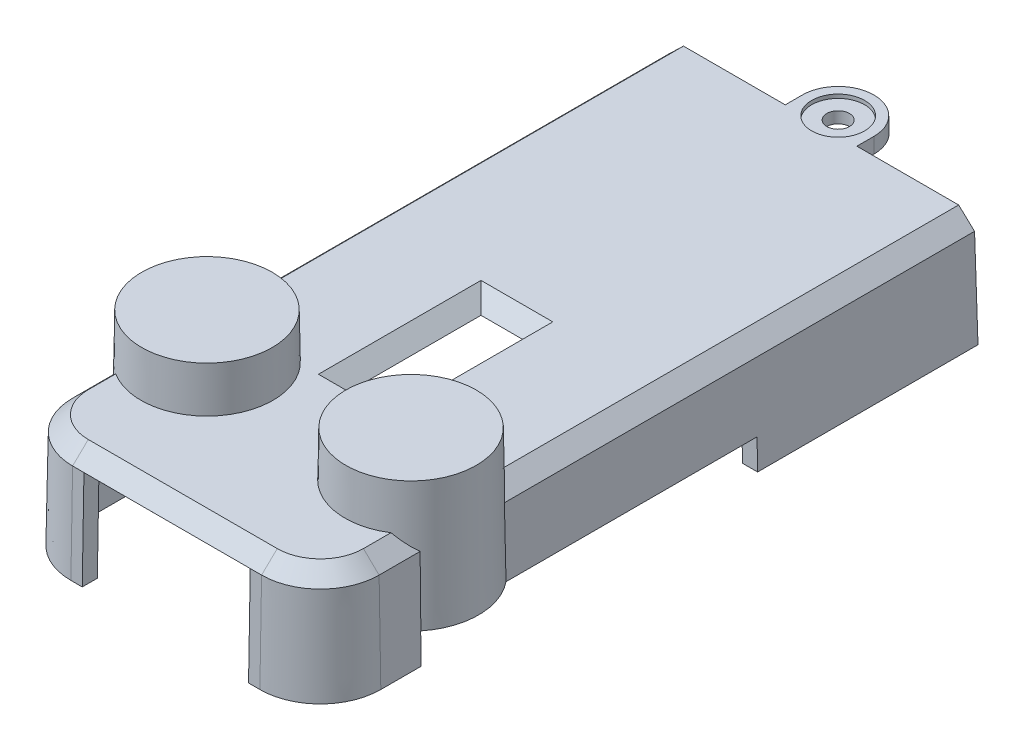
ISO-10303-21;
HEADER;
FILE_DESCRIPTION(('STEP AP214'),'2;1');
FILE_NAME('part.step','',(''),(''),'','','');
FILE_SCHEMA(('AUTOMOTIVE_DESIGN { 1 0 10303 214 1 1 1 1 }'));
ENDSEC;
DATA;
#1=APPLICATION_CONTEXT('core data for automotive mechanical design processes');
#2=APPLICATION_PROTOCOL_DEFINITION('international standard','automotive_design',2000,#1);
#3=PRODUCT_CONTEXT('',#1,'mechanical');
#4=PRODUCT('Part','Part','',(#3));
#5=PRODUCT_RELATED_PRODUCT_CATEGORY('part','',(#4));
#6=PRODUCT_DEFINITION_FORMATION('','',#4);
#7=PRODUCT_DEFINITION_CONTEXT('part definition',#1,'design');
#8=PRODUCT_DEFINITION('design','',#6,#7);
#9=PRODUCT_DEFINITION_SHAPE('','',#8);
#10=(LENGTH_UNIT() NAMED_UNIT(*) SI_UNIT(.MILLI.,.METRE.));
#11=(NAMED_UNIT(*) PLANE_ANGLE_UNIT() SI_UNIT($,.RADIAN.));
#12=(NAMED_UNIT(*) SI_UNIT($,.STERADIAN.) SOLID_ANGLE_UNIT());
#13=UNCERTAINTY_MEASURE_WITH_UNIT(LENGTH_MEASURE(1.E-05),#10,'distance_accuracy_value','');
#14=(GEOMETRIC_REPRESENTATION_CONTEXT(3) GLOBAL_UNCERTAINTY_ASSIGNED_CONTEXT((#13)) GLOBAL_UNIT_ASSIGNED_CONTEXT((#10,
#11,#12)) REPRESENTATION_CONTEXT('',''));
#15=CARTESIAN_POINT('',(0.,0.,0.));
#16=DIRECTION('',(0.,0.,1.));
#17=DIRECTION('',(1.,0.,0.));
#18=AXIS2_PLACEMENT_3D('',#15,#16,#17);
#19=CARTESIAN_POINT('',(13.5,21.,-19.));
#20=DIRECTION('',(0.,-1.,0.));
#21=DIRECTION('',(0.,0.,-1.));
#22=AXIS2_PLACEMENT_3D('',#19,#20,#21);
#23=PLANE('',#22);
#24=CARTESIAN_POINT('',(13.5,21.,-19.));
#25=DIRECTION('',(0.,-1.,0.));
#26=DIRECTION('',(0.,0.,-1.));
#27=AXIS2_PLACEMENT_3D('',#24,#25,#26);
#28=CIRCLE('',#27,8.63344363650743);
#29=CARTESIAN_POINT('',(13.5,21.,-27.6334436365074));
#30=VERTEX_POINT('',#29);
#31=EDGE_CURVE('E20',#30,#30,#28,.T.);
#32=ORIENTED_EDGE('',*,*,#31,.F.);
#33=EDGE_LOOP('',(#32));
#34=FACE_BOUND('',#33,.T.);
#35=ADVANCED_FACE('F17',(#34),#23,.F.);
#36=CARTESIAN_POINT('',(-13.5,21.,-19.));
#37=DIRECTION('',(0.,1.,0.));
#38=DIRECTION('',(0.,0.,1.));
#39=AXIS2_PLACEMENT_3D('',#36,#37,#38);
#40=PLANE('',#39);
#41=CARTESIAN_POINT('',(-13.5,21.,-19.));
#42=DIRECTION('',(0.,-1.,0.));
#43=DIRECTION('',(0.,0.,-1.));
#44=AXIS2_PLACEMENT_3D('',#41,#42,#43);
#45=CIRCLE('',#44,8.63344363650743);
#46=CARTESIAN_POINT('',(-13.5,21.,-27.6334436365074));
#47=VERTEX_POINT('',#46);
#48=EDGE_CURVE('E209',#47,#47,#45,.T.);
#49=ORIENTED_EDGE('',*,*,#48,.F.);
#50=EDGE_LOOP('',(#49));
#51=FACE_BOUND('',#50,.T.);
#52=ADVANCED_FACE('F1463',(#51),#40,.T.);
#53=CARTESIAN_POINT('',(-18.2023336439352,15.,-89.));
#54=DIRECTION('',(0.694658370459,-0.719339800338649,0.));
#55=DIRECTION('',(0.719339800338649,0.694658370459,0.));
#56=AXIS2_PLACEMENT_3D('',#53,#54,#55);
#57=PLANE('',#56);
#58=DIRECTION('',(0.,0.,1.));
#59=VECTOR('',#58,1.);
#60=CARTESIAN_POINT('',(-20.2730788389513,13.0003046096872,-87.));
#61=LINE('',#60,#59);
#62=CARTESIAN_POINT('',(-20.2730788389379,13.0003046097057,-8.00000000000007));
#63=VERTEX_POINT('',#62);
#64=CARTESIAN_POINT('',(-20.2730788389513,13.0003046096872,-13.423951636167));
#65=VERTEX_POINT('',#64);
#66=EDGE_CURVE('E225',#63,#65,#61,.F.);
#67=ORIENTED_EDGE('',*,*,#66,.F.);
#68=DIRECTION('',(0.719339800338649,0.694658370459,0.));
#69=VECTOR('',#68,1.);
#70=CARTESIAN_POINT('',(-499004.5,-481850.466438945,-8.00000000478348));
#71=LINE('',#70,#69);
#72=CARTESIAN_POINT('',(-18.2023336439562,15.0000000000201,-8.00000000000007));
#73=VERTEX_POINT('',#72);
#74=EDGE_CURVE('E578',#73,#63,#71,.F.);
#75=ORIENTED_EDGE('',*,*,#74,.F.);
#76=DIRECTION('',(0.,0.,1.));
#77=VECTOR('',#76,1.);
#78=CARTESIAN_POINT('',(-18.2023336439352,15.,-89.));
#79=LINE('',#78,#77);
#80=CARTESIAN_POINT('',(-18.2023336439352,15.,-11.634964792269));
#81=VERTEX_POINT('',#80);
#82=EDGE_CURVE('E342',#81,#73,#79,.T.);
#83=ORIENTED_EDGE('',*,*,#82,.F.);
#84=CARTESIAN_POINT('',(-13.6459974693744,19.4000026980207,-19.));
#85=DIRECTION('',(0.694658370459,-0.719339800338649,0.));
#86=DIRECTION('',(-0.719339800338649,-0.694658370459,0.));
#87=AXIS2_PLACEMENT_3D('',#84,#85,#86);
#88=ELLIPSE('',#87,12.040723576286,8.66014112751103);
#89=EDGE_CURVE('E211',#65,#81,#88,.F.);
#90=ORIENTED_EDGE('',*,*,#89,.F.);
#91=EDGE_LOOP('',(#67,#75,#83,#90));
#92=FACE_BOUND('',#91,.T.);
#93=ADVANCED_FACE('F1455',(#92),#57,.F.);
#94=CARTESIAN_POINT('',(18.2023336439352,15.,-89.));
#95=DIRECTION('',(-0.694658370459,-0.719339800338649,0.));
#96=DIRECTION('',(0.719339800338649,-0.694658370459,0.));
#97=AXIS2_PLACEMENT_3D('',#94,#95,#96);
#98=PLANE('',#97);
#99=DIRECTION('',(0.,0.,1.));
#100=VECTOR('',#99,1.);
#101=CARTESIAN_POINT('',(18.2023336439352,15.,-89.));
#102=LINE('',#101,#100);
#103=CARTESIAN_POINT('',(18.2023336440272,14.9999999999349,-8.00000000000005));
#104=VERTEX_POINT('',#103);
#105=CARTESIAN_POINT('',(18.2023336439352,15.,-11.634964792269));
#106=VERTEX_POINT('',#105);
#107=EDGE_CURVE('E194',#104,#106,#102,.F.);
#108=ORIENTED_EDGE('',*,*,#107,.F.);
#109=DIRECTION('',(-0.719339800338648,0.694658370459,0.));
#110=VECTOR('',#109,1.);
#111=CARTESIAN_POINT('',(499004.5,-481850.466438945,-8.00000000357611));
#112=LINE('',#111,#110);
#113=CARTESIAN_POINT('',(20.2730788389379,13.0003046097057,-8.00000000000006));
#114=VERTEX_POINT('',#113);
#115=EDGE_CURVE('E216',#114,#104,#112,.T.);
#116=ORIENTED_EDGE('',*,*,#115,.F.);
#117=DIRECTION('',(0.,0.,1.));
#118=VECTOR('',#117,1.);
#119=CARTESIAN_POINT('',(20.2730788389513,13.0003046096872,-87.));
#120=LINE('',#119,#118);
#121=CARTESIAN_POINT('',(20.2730788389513,13.0003046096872,-13.423951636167));
#122=VERTEX_POINT('',#121);
#123=EDGE_CURVE('E208',#122,#114,#120,.T.);
#124=ORIENTED_EDGE('',*,*,#123,.F.);
#125=CARTESIAN_POINT('',(13.6459974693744,19.4000026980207,-19.));
#126=DIRECTION('',(-0.694658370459,-0.719339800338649,0.));
#127=DIRECTION('',(0.719339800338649,-0.694658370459,0.));
#128=AXIS2_PLACEMENT_3D('',#125,#126,#127);
#129=ELLIPSE('',#128,12.040723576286,8.66014112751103);
#130=EDGE_CURVE('E186',#106,#122,#129,.F.);
#131=ORIENTED_EDGE('',*,*,#130,.F.);
#132=EDGE_LOOP('',(#108,#116,#124,#131));
#133=FACE_BOUND('',#132,.T.);
#134=ADVANCED_FACE('F206',(#133),#98,.F.);
#135=CARTESIAN_POINT('',(13.5,4.00000000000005,-19.));
#136=DIRECTION('',(0.,-1.,0.));
#137=DIRECTION('',(0.,0.,-1.));
#138=AXIS2_PLACEMENT_3D('',#135,#136,#137);
#139=CONICAL_SURFACE('',#138,8.93017974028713,0.0174532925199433);
#140=CARTESIAN_POINT('',(13.5,15.,-19.));
#141=DIRECTION('',(0.,-1.,0.));
#142=DIRECTION('',(0.,0.,-1.));
#143=AXIS2_PLACEMENT_3D('',#140,#141,#142);
#144=CIRCLE('',#143,8.73817402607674);
#145=CARTESIAN_POINT('',(18.2023336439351,15.,-26.3650352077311));
#146=VERTEX_POINT('',#145);
#147=EDGE_CURVE('E181',#106,#146,#144,.T.);
#148=ORIENTED_EDGE('',*,*,#147,.F.);
#149=ORIENTED_EDGE('',*,*,#130,.T.);
#150=CARTESIAN_POINT('',(20.4301797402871,4.,-13.3678850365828));
#151=CARTESIAN_POINT('',(20.4039962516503,5.50005105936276,-13.3771827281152));
#152=CARTESIAN_POINT('',(20.3778127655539,7.00010197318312,-13.3865037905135));
#153=CARTESIAN_POINT('',(20.325445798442,10.0002035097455,-13.4051926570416));
#154=CARTESIAN_POINT('',(20.2992623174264,11.5002541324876,-13.4145604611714));
#155=CARTESIAN_POINT('',(20.2730788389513,13.0003046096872,-13.423951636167));
#156=B_SPLINE_CURVE_WITH_KNOTS('',3,(#150,#151,#152,#153,#154,#155),.UNSPECIFIED.,.F.,.F.,(4,2,
4),(0.,4.50092510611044,9.00185021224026),.UNSPECIFIED.);
#157=CARTESIAN_POINT('',(20.4301797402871,4.,-13.3678850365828));
#158=VERTEX_POINT('',#157);
#159=EDGE_CURVE('E224',#158,#122,#156,.T.);
#160=ORIENTED_EDGE('',*,*,#159,.F.);
#161=CARTESIAN_POINT('',(13.5,4.,-19.));
#162=DIRECTION('',(0.,-1.,0.));
#163=DIRECTION('',(0.,0.,-1.));
#164=AXIS2_PLACEMENT_3D('',#161,#162,#163);
#165=CIRCLE('',#164,8.93017974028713);
#166=CARTESIAN_POINT('',(20.4301797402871,4.,-24.6321149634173));
#167=VERTEX_POINT('',#166);
#168=EDGE_CURVE('E489',#158,#167,#165,.F.);
#169=ORIENTED_EDGE('',*,*,#168,.T.);
#170=CARTESIAN_POINT('',(20.2730788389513,13.0003046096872,-24.5760483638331));
#171=CARTESIAN_POINT('',(20.2992623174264,11.5002541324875,-24.5854395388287));
#172=CARTESIAN_POINT('',(20.325445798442,10.0002035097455,-24.5948073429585));
#173=CARTESIAN_POINT('',(20.3778127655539,7.00010197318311,-24.6134962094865));
#174=CARTESIAN_POINT('',(20.4039962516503,5.50005105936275,-24.6228172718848));
#175=CARTESIAN_POINT('',(20.4301797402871,4.,-24.6321149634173));
#176=B_SPLINE_CURVE_WITH_KNOTS('',3,(#170,#171,#172,#173,#174,#175),.UNSPECIFIED.,.F.,.F.,(4,2,
4),(0.,4.50092510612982,9.00185021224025),.UNSPECIFIED.);
#177=CARTESIAN_POINT('',(20.2730788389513,13.0003046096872,-24.5760483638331));
#178=VERTEX_POINT('',#177);
#179=EDGE_CURVE('E358',#178,#167,#176,.T.);
#180=ORIENTED_EDGE('',*,*,#179,.F.);
#181=CARTESIAN_POINT('',(13.6459974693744,19.4000026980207,-19.));
#182=DIRECTION('',(-0.694658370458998,-0.71933980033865,0.));
#183=DIRECTION('',(0.71933980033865,-0.694658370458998,0.));
#184=AXIS2_PLACEMENT_3D('',#181,#182,#183);
#185=ELLIPSE('',#184,12.040723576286,8.66014112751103);
#186=EDGE_CURVE('E189',#178,#146,#185,.F.);
#187=ORIENTED_EDGE('',*,*,#186,.T.);
#188=EDGE_LOOP('',(#148,#149,#160,#169,#180,#187));
#189=FACE_BOUND('',#188,.T.);
#190=ORIENTED_EDGE('',*,*,#31,.T.);
#191=EDGE_LOOP('',(#190));
#192=FACE_BOUND('',#191,.T.);
#193=ADVANCED_FACE('F183',(#189,#192),#139,.T.);
#194=CARTESIAN_POINT('',(0.,15.,-89.));
#195=DIRECTION('',(0.,1.,0.));
#196=DIRECTION('',(0.,0.,1.));
#197=AXIS2_PLACEMENT_3D('',#194,#195,#196);
#198=CYLINDRICAL_SURFACE('',#197,3.5);
#199=CARTESIAN_POINT('',(0.,15.,-89.));
#200=DIRECTION('',(0.,1.,0.));
#201=DIRECTION('',(0.,0.,1.));
#202=AXIS2_PLACEMENT_3D('',#199,#200,#201);
#203=CIRCLE('',#202,3.5);
#204=CARTESIAN_POINT('',(0.,15.,-85.5));
#205=VERTEX_POINT('',#204);
#206=EDGE_CURVE('E335',#205,#205,#203,.F.);
#207=ORIENTED_EDGE('',*,*,#206,.F.);
#208=EDGE_LOOP('',(#207));
#209=FACE_BOUND('',#208,.T.);
#210=CARTESIAN_POINT('',(0.,14.5,-89.));
#211=DIRECTION('',(0.,1.,0.));
#212=DIRECTION('',(0.,0.,1.));
#213=AXIS2_PLACEMENT_3D('',#210,#211,#212);
#214=CIRCLE('',#213,3.5);
#215=CARTESIAN_POINT('',(0.,14.5,-85.5));
#216=VERTEX_POINT('',#215);
#217=EDGE_CURVE('E405',#216,#216,#214,.F.);
#218=ORIENTED_EDGE('',*,*,#217,.T.);
#219=EDGE_LOOP('',(#218));
#220=FACE_BOUND('',#219,.T.);
#221=ADVANCED_FACE('F254',(#209,#220),#198,.F.);
#222=CARTESIAN_POINT('',(-13.5,3.99999999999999,-19.));
#223=DIRECTION('',(0.,-1.,0.));
#224=DIRECTION('',(0.,0.,-1.));
#225=AXIS2_PLACEMENT_3D('',#222,#223,#224);
#226=CONICAL_SURFACE('',#225,8.93017974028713,0.0174532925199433);
#227=CARTESIAN_POINT('',(-13.5,15.,-19.));
#228=DIRECTION('',(0.,-1.,0.));
#229=DIRECTION('',(0.,0.,-1.));
#230=AXIS2_PLACEMENT_3D('',#227,#228,#229);
#231=CIRCLE('',#230,8.73817402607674);
#232=CARTESIAN_POINT('',(-18.2023336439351,15.,-26.3650352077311));
#233=VERTEX_POINT('',#232);
#234=EDGE_CURVE('E343',#233,#81,#231,.T.);
#235=ORIENTED_EDGE('',*,*,#234,.F.);
#236=CARTESIAN_POINT('',(-13.6459974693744,19.4000026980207,-19.));
#237=DIRECTION('',(0.694658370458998,-0.71933980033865,0.));
#238=DIRECTION('',(-0.71933980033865,-0.694658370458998,0.));
#239=AXIS2_PLACEMENT_3D('',#236,#237,#238);
#240=ELLIPSE('',#239,12.040723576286,8.66014112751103);
#241=CARTESIAN_POINT('',(-20.2730788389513,13.0003046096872,-24.5760483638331));
#242=VERTEX_POINT('',#241);
#243=EDGE_CURVE('E347',#233,#242,#240,.F.);
#244=ORIENTED_EDGE('',*,*,#243,.T.);
#245=CARTESIAN_POINT('',(-20.4301797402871,4.,-24.6321149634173));
#246=CARTESIAN_POINT('',(-20.4039962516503,5.50005105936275,-24.6228172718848));
#247=CARTESIAN_POINT('',(-20.3778127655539,7.00010197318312,-24.6134962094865));
#248=CARTESIAN_POINT('',(-20.325445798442,10.0002035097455,-24.5948073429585));
#249=CARTESIAN_POINT('',(-20.2992623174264,11.5002541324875,-24.5854395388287));
#250=CARTESIAN_POINT('',(-20.2730788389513,13.0003046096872,-24.5760483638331));
#251=B_SPLINE_CURVE_WITH_KNOTS('',3,(#245,#246,#247,#248,#249,#250),.UNSPECIFIED.,.F.,.F.,(4,2,
4),(0.,4.50092510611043,9.00185021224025),.UNSPECIFIED.);
#252=CARTESIAN_POINT('',(-20.4301797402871,4.,-24.6321149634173));
#253=VERTEX_POINT('',#252);
#254=EDGE_CURVE('E351',#253,#242,#251,.T.);
#255=ORIENTED_EDGE('',*,*,#254,.F.);
#256=CARTESIAN_POINT('',(-13.5,3.99999999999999,-19.));
#257=DIRECTION('',(0.,-1.,0.));
#258=DIRECTION('',(0.,0.,-1.));
#259=AXIS2_PLACEMENT_3D('',#256,#257,#258);
#260=CIRCLE('',#259,8.93017974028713);
#261=CARTESIAN_POINT('',(-20.4301797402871,4.,-13.3678850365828));
#262=VERTEX_POINT('',#261);
#263=EDGE_CURVE('E330',#253,#262,#260,.F.);
#264=ORIENTED_EDGE('',*,*,#263,.T.);
#265=CARTESIAN_POINT('',(-20.2730788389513,13.0003046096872,-13.423951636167));
#266=CARTESIAN_POINT('',(-20.2992623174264,11.5002541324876,-13.4145604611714));
#267=CARTESIAN_POINT('',(-20.325445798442,10.0002035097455,-13.4051926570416));
#268=CARTESIAN_POINT('',(-20.3778127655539,7.00010197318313,-13.3865037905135));
#269=CARTESIAN_POINT('',(-20.4039962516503,5.50005105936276,-13.3771827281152));
#270=CARTESIAN_POINT('',(-20.4301797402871,4.,-13.3678850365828));
#271=B_SPLINE_CURVE_WITH_KNOTS('',3,(#265,#266,#267,#268,#269,#270),.UNSPECIFIED.,.F.,.F.,(4,2,
4),(0.,4.50092510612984,9.00185021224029),.UNSPECIFIED.);
#272=EDGE_CURVE('E217',#65,#262,#271,.T.);
#273=ORIENTED_EDGE('',*,*,#272,.F.);
#274=ORIENTED_EDGE('',*,*,#89,.T.);
#275=EDGE_LOOP('',(#235,#244,#255,#264,#273,#274));
#276=FACE_BOUND('',#275,.T.);
#277=ORIENTED_EDGE('',*,*,#48,.T.);
#278=EDGE_LOOP('',(#277));
#279=FACE_BOUND('',#278,.T.);
#280=ADVANCED_FACE('F232',(#276,#279),#226,.T.);
#281=CARTESIAN_POINT('',(12.5,13.0003046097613,-8.00000000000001));
#282=DIRECTION('',(0.,-1.,0.));
#283=DIRECTION('',(0.,0.,-1.));
#284=AXIS2_PLACEMENT_3D('',#281,#282,#283);
#285=CONICAL_SURFACE('',#284,7.77307883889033,0.802851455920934);
#286=DIRECTION('',(0.,0.694658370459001,-0.719339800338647));
#287=VECTOR('',#286,1.);
#288=CARTESIAN_POINT('',(12.4999999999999,15.,-2.29766635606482));
#289=LINE('',#288,#287);
#290=CARTESIAN_POINT('',(12.4999999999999,14.9999999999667,-2.29766635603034));
#291=VERTEX_POINT('',#290);
#292=CARTESIAN_POINT('',(12.4999999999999,13.0003046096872,-0.226921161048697));
#293=VERTEX_POINT('',#292);
#294=EDGE_CURVE('E583',#291,#293,#289,.F.);
#295=ORIENTED_EDGE('',*,*,#294,.T.);
#296=CARTESIAN_POINT('',(12.5,13.0003046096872,-8.00000000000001));
#297=DIRECTION('',(0.,-1.,0.));
#298=DIRECTION('',(0.,0.,-1.));
#299=AXIS2_PLACEMENT_3D('',#296,#297,#298);
#300=CIRCLE('',#299,7.7730788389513);
#301=EDGE_CURVE('E556',#114,#293,#300,.T.);
#302=ORIENTED_EDGE('',*,*,#301,.F.);
#303=ORIENTED_EDGE('',*,*,#115,.T.);
#304=CARTESIAN_POINT('',(12.5,14.9999999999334,-8.00000000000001));
#305=DIRECTION('',(0.,-1.,0.));
#306=DIRECTION('',(0.,0.,-1.));
#307=AXIS2_PLACEMENT_3D('',#304,#305,#306);
#308=CIRCLE('',#307,5.70233364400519);
#309=EDGE_CURVE('E201',#291,#104,#308,.F.);
#310=ORIENTED_EDGE('',*,*,#309,.F.);
#311=EDGE_LOOP('',(#295,#302,#303,#310));
#312=FACE_BOUND('',#311,.T.);
#313=ADVANCED_FACE('F246',(#312),#285,.T.);
#314=CARTESIAN_POINT('',(-12.5,13.0003046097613,-8.00000000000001));
#315=DIRECTION('',(0.,-1.,0.));
#316=DIRECTION('',(0.,0.,-1.));
#317=AXIS2_PLACEMENT_3D('',#314,#315,#316);
#318=CONICAL_SURFACE('',#317,7.77307883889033,0.802851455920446);
#319=ORIENTED_EDGE('',*,*,#74,.T.);
#320=CARTESIAN_POINT('',(-12.5,13.0003046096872,-8.00000000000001));
#321=DIRECTION('',(0.,-1.,0.));
#322=DIRECTION('',(0.,0.,1.));
#323=AXIS2_PLACEMENT_3D('',#320,#321,#322);
#324=CIRCLE('',#323,7.7730788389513);
#325=CARTESIAN_POINT('',(-12.5,13.0003046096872,-0.226921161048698));
#326=VERTEX_POINT('',#325);
#327=EDGE_CURVE('E567',#326,#63,#324,.T.);
#328=ORIENTED_EDGE('',*,*,#327,.F.);
#329=DIRECTION('',(0.,0.694658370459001,-0.719339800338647));
#330=VECTOR('',#329,1.);
#331=CARTESIAN_POINT('',(-12.5,15.,-2.29766635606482));
#332=LINE('',#331,#330);
#333=CARTESIAN_POINT('',(-12.5,14.9999999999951,-2.29766635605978));
#334=VERTEX_POINT('',#333);
#335=EDGE_CURVE('E590',#326,#334,#332,.T.);
#336=ORIENTED_EDGE('',*,*,#335,.T.);
#337=CARTESIAN_POINT('',(-12.5,14.9999999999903,-8.00000000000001));
#338=DIRECTION('',(0.,-1.,0.));
#339=DIRECTION('',(0.,0.,-1.));
#340=AXIS2_PLACEMENT_3D('',#337,#338,#339);
#341=CIRCLE('',#340,5.70233364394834);
#342=EDGE_CURVE('E340',#73,#334,#341,.F.);
#343=ORIENTED_EDGE('',*,*,#342,.F.);
#344=EDGE_LOOP('',(#319,#328,#336,#343));
#345=FACE_BOUND('',#344,.T.);
#346=ADVANCED_FACE('F241',(#345),#318,.T.);
#347=CARTESIAN_POINT('',(-20.5,0.,-87.));
#348=DIRECTION('',(-0.999847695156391,0.0174524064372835,0.));
#349=DIRECTION('',(-0.0174524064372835,-0.999847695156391,0.));
#350=AXIS2_PLACEMENT_3D('',#347,#348,#349);
#351=PLANE('',#350);
#352=DIRECTION('',(-0.0174524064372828,-0.999847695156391,0.));
#353=VECTOR('',#352,1.);
#354=CARTESIAN_POINT('',(-20.4301797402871,4.,-13.3431457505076));
#355=LINE('',#354,#353);
#356=CARTESIAN_POINT('',(-20.4301797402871,4.,-13.3431457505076));
#357=VERTEX_POINT('',#356);
#358=CARTESIAN_POINT('',(-20.5,0.,-13.3431457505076));
#359=VERTEX_POINT('',#358);
#360=EDGE_CURVE('E333',#357,#359,#355,.T.);
#361=ORIENTED_EDGE('',*,*,#360,.T.);
#362=DIRECTION('',(0.,0.,1.));
#363=VECTOR('',#362,1.);
#364=CARTESIAN_POINT('',(-20.5,0.,-89.));
#365=LINE('',#364,#363);
#366=CARTESIAN_POINT('',(-20.5,0.,-8.00000000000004));
#367=VERTEX_POINT('',#366);
#368=EDGE_CURVE('E815',#359,#367,#365,.T.);
#369=ORIENTED_EDGE('',*,*,#368,.T.);
#370=DIRECTION('',(0.0174524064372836,0.999847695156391,0.));
#371=VECTOR('',#370,1.);
#372=CARTESIAN_POINT('',(-20.5,0.,-8.00000000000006));
#373=LINE('',#372,#371);
#374=EDGE_CURVE('E329',#63,#367,#373,.F.);
#375=ORIENTED_EDGE('',*,*,#374,.F.);
#376=ORIENTED_EDGE('',*,*,#66,.T.);
#377=ORIENTED_EDGE('',*,*,#272,.T.);
#378=DIRECTION('',(0.,0.,1.));
#379=VECTOR('',#378,1.);
#380=CARTESIAN_POINT('',(-20.4301797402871,4.,-13.3431457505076));
#381=LINE('',#380,#379);
#382=EDGE_CURVE('E850',#262,#357,#381,.T.);
#383=ORIENTED_EDGE('',*,*,#382,.T.);
#384=EDGE_LOOP('',(#361,#369,#375,#376,#377,#383));
#385=FACE_BOUND('',#384,.T.);
#386=ADVANCED_FACE('F236',(#385),#351,.T.);
#387=CARTESIAN_POINT('',(20.5,0.,-87.));
#388=DIRECTION('',(0.999847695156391,0.0174524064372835,0.));
#389=DIRECTION('',(-0.0174524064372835,0.999847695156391,0.));
#390=AXIS2_PLACEMENT_3D('',#387,#388,#389);
#391=PLANE('',#390);
#392=DIRECTION('',(-0.0174524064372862,0.999847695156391,0.));
#393=VECTOR('',#392,1.);
#394=CARTESIAN_POINT('',(20.5,0.,-13.3431457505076));
#395=LINE('',#394,#393);
#396=CARTESIAN_POINT('',(20.5,0.,-13.3431457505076));
#397=VERTEX_POINT('',#396);
#398=CARTESIAN_POINT('',(20.4301797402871,4.,-13.3431457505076));
#399=VERTEX_POINT('',#398);
#400=EDGE_CURVE('E535',#397,#399,#395,.T.);
#401=ORIENTED_EDGE('',*,*,#400,.T.);
#402=DIRECTION('',(0.,0.,1.));
#403=VECTOR('',#402,1.);
#404=CARTESIAN_POINT('',(20.4301797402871,4.,-13.3431457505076));
#405=LINE('',#404,#403);
#406=EDGE_CURVE('E491',#399,#158,#405,.F.);
#407=ORIENTED_EDGE('',*,*,#406,.T.);
#408=ORIENTED_EDGE('',*,*,#159,.T.);
#409=ORIENTED_EDGE('',*,*,#123,.T.);
#410=DIRECTION('',(-0.0174524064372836,0.999847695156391,0.));
#411=VECTOR('',#410,1.);
#412=CARTESIAN_POINT('',(20.5,0.,-8.00000000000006));
#413=LINE('',#412,#411);
#414=CARTESIAN_POINT('',(20.5,0.,-8.00000000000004));
#415=VERTEX_POINT('',#414);
#416=EDGE_CURVE('E553',#415,#114,#413,.T.);
#417=ORIENTED_EDGE('',*,*,#416,.F.);
#418=DIRECTION('',(0.,0.,1.));
#419=VECTOR('',#418,1.);
#420=CARTESIAN_POINT('',(20.5,0.,-89.));
#421=LINE('',#420,#419);
#422=EDGE_CURVE('E324',#415,#397,#421,.F.);
#423=ORIENTED_EDGE('',*,*,#422,.T.);
#424=EDGE_LOOP('',(#401,#407,#408,#409,#417,#423));
#425=FACE_BOUND('',#424,.T.);
#426=ADVANCED_FACE('F240',(#425),#391,.T.);
#427=CARTESIAN_POINT('',(1.5,14.5,-89.));
#428=DIRECTION('',(0.,-1.,0.));
#429=DIRECTION('',(0.,0.,-1.));
#430=AXIS2_PLACEMENT_3D('',#427,#428,#429);
#431=PLANE('',#430);
#432=ORIENTED_EDGE('',*,*,#217,.F.);
#433=EDGE_LOOP('',(#432));
#434=FACE_BOUND('',#433,.T.);
#435=CARTESIAN_POINT('',(0.,14.5,-89.));
#436=DIRECTION('',(0.,1.,0.));
#437=DIRECTION('',(0.,0.,1.));
#438=AXIS2_PLACEMENT_3D('',#435,#436,#437);
#439=CIRCLE('',#438,1.5);
#440=CARTESIAN_POINT('',(0.,14.5,-87.5));
#441=VERTEX_POINT('',#440);
#442=EDGE_CURVE('E316',#441,#441,#439,.F.);
#443=ORIENTED_EDGE('',*,*,#442,.T.);
#444=EDGE_LOOP('',(#443));
#445=FACE_BOUND('',#444,.T.);
#446=ADVANCED_FACE('F394',(#434,#445),#431,.F.);
#447=CARTESIAN_POINT('',(13.5,19.,-19.));
#448=DIRECTION('',(0.,-1.,0.));
#449=DIRECTION('',(0.,0.,-1.));
#450=AXIS2_PLACEMENT_3D('',#447,#448,#449);
#451=PLANE('',#450);
#452=CARTESIAN_POINT('',(13.5,19.,-19.));
#453=DIRECTION('',(0.,-1.,0.));
#454=DIRECTION('',(0.,0.,-1.));
#455=AXIS2_PLACEMENT_3D('',#452,#453,#454);
#456=CIRCLE('',#455,6.66804911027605);
#457=CARTESIAN_POINT('',(13.5,19.,-25.6680491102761));
#458=VERTEX_POINT('',#457);
#459=EDGE_CURVE('E309',#458,#458,#456,.T.);
#460=ORIENTED_EDGE('',*,*,#459,.T.);
#461=EDGE_LOOP('',(#460));
#462=FACE_BOUND('',#461,.T.);
#463=ADVANCED_FACE('F391',(#462),#451,.T.);
#464=CARTESIAN_POINT('',(-22.5,0.,-57.8431457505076));
#465=DIRECTION('',(0.,0.,-1.));
#466=DIRECTION('',(-1.,0.,0.));
#467=AXIS2_PLACEMENT_3D('',#464,#465,#466);
#468=PLANE('',#467);
#469=DIRECTION('',(-0.0174524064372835,0.999847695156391,0.));
#470=VECTOR('',#469,1.);
#471=CARTESIAN_POINT('',(18.5003046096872,-0.0349048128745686,-57.8431457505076));
#472=LINE('',#471,#470);
#473=CARTESIAN_POINT('',(18.4298750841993,4.,-57.8431457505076));
#474=VERTEX_POINT('',#473);
#475=CARTESIAN_POINT('',(18.4996953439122,0.,-57.8431457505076));
#476=VERTEX_POINT('',#475);
#477=EDGE_CURVE('E312',#474,#476,#472,.F.);
#478=ORIENTED_EDGE('',*,*,#477,.T.);
#479=DIRECTION('',(1.,0.,0.));
#480=VECTOR('',#479,1.);
#481=CARTESIAN_POINT('',(0.,0.,-57.8431457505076));
#482=LINE('',#481,#480);
#483=CARTESIAN_POINT('',(20.5,0.,-57.8431457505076));
#484=VERTEX_POINT('',#483);
#485=EDGE_CURVE('E529',#476,#484,#482,.T.);
#486=ORIENTED_EDGE('',*,*,#485,.T.);
#487=DIRECTION('',(-0.0174524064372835,0.999847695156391,0.));
#488=VECTOR('',#487,1.);
#489=CARTESIAN_POINT('',(20.5,0.,-57.8431457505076));
#490=LINE('',#489,#488);
#491=CARTESIAN_POINT('',(20.4301797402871,4.,-57.8431457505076));
#492=VERTEX_POINT('',#491);
#493=EDGE_CURVE('E532',#492,#484,#490,.F.);
#494=ORIENTED_EDGE('',*,*,#493,.F.);
#495=DIRECTION('',(1.,0.,0.));
#496=VECTOR('',#495,1.);
#497=CARTESIAN_POINT('',(-22.5,4.,-57.8431457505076));
#498=LINE('',#497,#496);
#499=EDGE_CURVE('E483',#492,#474,#498,.F.);
#500=ORIENTED_EDGE('',*,*,#499,.T.);
#501=EDGE_LOOP('',(#478,#486,#494,#500));
#502=FACE_BOUND('',#501,.T.);
#503=ADVANCED_FACE('F387',(#502),#468,.F.);
#504=CARTESIAN_POINT('',(-22.5,4.,-13.3431457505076));
#505=DIRECTION('',(0.,1.,0.));
#506=DIRECTION('',(0.,0.,1.));
#507=AXIS2_PLACEMENT_3D('',#504,#505,#506);
#508=PLANE('',#507);
#509=ORIENTED_EDGE('',*,*,#406,.F.);
#510=DIRECTION('',(1.,0.,0.));
#511=VECTOR('',#510,1.);
#512=CARTESIAN_POINT('',(-22.5,4.,-13.3431457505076));
#513=LINE('',#512,#511);
#514=CARTESIAN_POINT('',(18.4298750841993,4.,-13.3431457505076));
#515=VERTEX_POINT('',#514);
#516=EDGE_CURVE('E538',#399,#515,#513,.F.);
#517=ORIENTED_EDGE('',*,*,#516,.T.);
#518=DIRECTION('',(0.,0.,1.));
#519=VECTOR('',#518,1.);
#520=CARTESIAN_POINT('',(18.4298750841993,4.,-13.3431457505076));
#521=LINE('',#520,#519);
#522=CARTESIAN_POINT('',(18.4298750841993,4.,-14.1297330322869));
#523=VERTEX_POINT('',#522);
#524=EDGE_CURVE('E485',#523,#515,#521,.T.);
#525=ORIENTED_EDGE('',*,*,#524,.F.);
#526=CARTESIAN_POINT('',(13.5,4.,-19.));
#527=DIRECTION('',(0.,-1.,0.));
#528=DIRECTION('',(0.,0.,-1.));
#529=AXIS2_PLACEMENT_3D('',#526,#527,#528);
#530=CIRCLE('',#529,6.92987508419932);
#531=CARTESIAN_POINT('',(18.4298750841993,4.,-23.8702669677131));
#532=VERTEX_POINT('',#531);
#533=EDGE_CURVE('E313',#523,#532,#530,.F.);
#534=ORIENTED_EDGE('',*,*,#533,.T.);
#535=DIRECTION('',(0.,0.,1.));
#536=VECTOR('',#535,1.);
#537=CARTESIAN_POINT('',(18.4298750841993,4.,-87.));
#538=LINE('',#537,#536);
#539=EDGE_CURVE('E305',#532,#474,#538,.F.);
#540=ORIENTED_EDGE('',*,*,#539,.T.);
#541=ORIENTED_EDGE('',*,*,#499,.F.);
#542=DIRECTION('',(0.,0.,1.));
#543=VECTOR('',#542,1.);
#544=CARTESIAN_POINT('',(20.4301797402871,4.,-87.));
#545=LINE('',#544,#543);
#546=EDGE_CURVE('E497',#167,#492,#545,.F.);
#547=ORIENTED_EDGE('',*,*,#546,.F.);
#548=ORIENTED_EDGE('',*,*,#168,.F.);
#549=EDGE_LOOP('',(#509,#517,#525,#534,#540,#541,#547,#548));
#550=FACE_BOUND('',#549,.T.);
#551=ADVANCED_FACE('F383',(#550),#508,.F.);
#552=CARTESIAN_POINT('',(18.2023336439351,15.,-89.));
#553=DIRECTION('',(-0.694658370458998,-0.71933980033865,0.));
#554=DIRECTION('',(0.71933980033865,-0.694658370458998,0.));
#555=AXIS2_PLACEMENT_3D('',#552,#553,#554);
#556=PLANE('',#555);
#557=DIRECTION('',(0.,0.,1.));
#558=VECTOR('',#557,1.);
#559=CARTESIAN_POINT('',(20.2730788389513,13.0003046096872,-87.));
#560=LINE('',#559,#558);
#561=CARTESIAN_POINT('',(20.2730788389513,13.0003046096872,-86.7730788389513));
#562=VERTEX_POINT('',#561);
#563=EDGE_CURVE('E492',#562,#178,#560,.T.);
#564=ORIENTED_EDGE('',*,*,#563,.F.);
#565=DIRECTION('',(0.719286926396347,-0.694607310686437,-0.0121244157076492));
#566=VECTOR('',#565,1.);
#567=CARTESIAN_POINT('',(18.2023336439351,15.,-86.7381740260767));
#568=LINE('',#567,#566);
#569=CARTESIAN_POINT('',(18.2023336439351,15.,-86.7381740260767));
#570=VERTEX_POINT('',#569);
#571=EDGE_CURVE('E504',#570,#562,#568,.T.);
#572=ORIENTED_EDGE('',*,*,#571,.F.);
#573=DIRECTION('',(0.,0.,1.));
#574=VECTOR('',#573,1.);
#575=CARTESIAN_POINT('',(18.2023336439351,15.,-89.));
#576=LINE('',#575,#574);
#577=EDGE_CURVE('E193',#146,#570,#576,.F.);
#578=ORIENTED_EDGE('',*,*,#577,.F.);
#579=ORIENTED_EDGE('',*,*,#186,.F.);
#580=EDGE_LOOP('',(#564,#572,#578,#579));
#581=FACE_BOUND('',#580,.T.);
#582=ADVANCED_FACE('F379',(#581),#556,.F.);
#583=CARTESIAN_POINT('',(20.5,0.,-87.));
#584=DIRECTION('',(0.999847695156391,0.0174524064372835,0.));
#585=DIRECTION('',(-0.0174524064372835,0.999847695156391,0.));
#586=AXIS2_PLACEMENT_3D('',#583,#584,#585);
#587=PLANE('',#586);
#588=ORIENTED_EDGE('',*,*,#493,.T.);
#589=DIRECTION('',(0.,0.,1.));
#590=VECTOR('',#589,1.);
#591=CARTESIAN_POINT('',(20.5,0.,-89.));
#592=LINE('',#591,#590);
#593=CARTESIAN_POINT('',(20.5,0.,-87.));
#594=VERTEX_POINT('',#593);
#595=EDGE_CURVE('E357',#484,#594,#592,.F.);
#596=ORIENTED_EDGE('',*,*,#595,.T.);
#597=DIRECTION('',(0.0174497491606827,-0.999695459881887,-0.0174497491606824));
#598=VECTOR('',#597,1.);
#599=CARTESIAN_POINT('',(20.2730788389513,13.0003046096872,-86.7730788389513));
#600=LINE('',#599,#598);
#601=EDGE_CURVE('E507',#562,#594,#600,.T.);
#602=ORIENTED_EDGE('',*,*,#601,.F.);
#603=ORIENTED_EDGE('',*,*,#563,.T.);
#604=ORIENTED_EDGE('',*,*,#179,.T.);
#605=ORIENTED_EDGE('',*,*,#546,.T.);
#606=EDGE_LOOP('',(#588,#596,#602,#603,#604,#605));
#607=FACE_BOUND('',#606,.T.);
#608=ADVANCED_FACE('F374',(#607),#587,.T.);
#609=CARTESIAN_POINT('',(0.,0.,-89.));
#610=DIRECTION('',(0.,1.,0.));
#611=DIRECTION('',(0.,0.,1.));
#612=AXIS2_PLACEMENT_3D('',#609,#610,#611);
#613=PLANE('',#612);
#614=ORIENTED_EDGE('',*,*,#485,.F.);
#615=DIRECTION('',(0.,0.,1.));
#616=VECTOR('',#615,1.);
#617=CARTESIAN_POINT('',(18.4996953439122,0.,-87.));
#618=LINE('',#617,#616);
#619=CARTESIAN_POINT('',(18.4996953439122,0.,-87.));
#620=VERTEX_POINT('',#619);
#621=EDGE_CURVE('E306',#476,#620,#618,.F.);
#622=ORIENTED_EDGE('',*,*,#621,.T.);
#623=DIRECTION('',(1.,0.,0.));
#624=VECTOR('',#623,1.);
#625=CARTESIAN_POINT('',(5.,0.,-87.));
#626=LINE('',#625,#624);
#627=EDGE_CURVE('E736',#594,#620,#626,.F.);
#628=ORIENTED_EDGE('',*,*,#627,.F.);
#629=ORIENTED_EDGE('',*,*,#595,.F.);
#630=EDGE_LOOP('',(#614,#622,#628,#629));
#631=FACE_BOUND('',#630,.T.);
#632=ADVANCED_FACE('F370',(#631),#613,.F.);
#633=CARTESIAN_POINT('',(-20.5,0.,-87.));
#634=DIRECTION('',(-0.999847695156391,0.0174524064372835,0.));
#635=DIRECTION('',(-0.0174524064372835,-0.999847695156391,0.));
#636=AXIS2_PLACEMENT_3D('',#633,#634,#635);
#637=PLANE('',#636);
#638=DIRECTION('',(0.0174524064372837,0.999847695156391,0.));
#639=VECTOR('',#638,1.);
#640=CARTESIAN_POINT('',(-20.5,0.,-57.8431457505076));
#641=LINE('',#640,#639);
#642=CARTESIAN_POINT('',(-20.5,0.,-57.8431457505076));
#643=VERTEX_POINT('',#642);
#644=CARTESIAN_POINT('',(-20.4301797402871,4.,-57.8431457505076));
#645=VERTEX_POINT('',#644);
#646=EDGE_CURVE('E634',#643,#645,#641,.T.);
#647=ORIENTED_EDGE('',*,*,#646,.T.);
#648=DIRECTION('',(0.,0.,1.));
#649=VECTOR('',#648,1.);
#650=CARTESIAN_POINT('',(-20.4301797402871,4.,-13.3431457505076));
#651=LINE('',#650,#649);
#652=EDGE_CURVE('E334',#645,#253,#651,.T.);
#653=ORIENTED_EDGE('',*,*,#652,.T.);
#654=ORIENTED_EDGE('',*,*,#254,.T.);
#655=DIRECTION('',(0.,0.,1.));
#656=VECTOR('',#655,1.);
#657=CARTESIAN_POINT('',(-20.2730788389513,13.0003046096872,-89.));
#658=LINE('',#657,#656);
#659=CARTESIAN_POINT('',(-20.2730788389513,13.0003046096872,-86.7730788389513));
#660=VERTEX_POINT('',#659);
#661=EDGE_CURVE('E350',#242,#660,#658,.F.);
#662=ORIENTED_EDGE('',*,*,#661,.T.);
#663=DIRECTION('',(0.0174497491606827,0.999695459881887,0.0174497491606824));
#664=VECTOR('',#663,1.);
#665=CARTESIAN_POINT('',(-20.5,0.,-87.));
#666=LINE('',#665,#664);
#667=CARTESIAN_POINT('',(-20.5,0.,-87.));
#668=VERTEX_POINT('',#667);
#669=EDGE_CURVE('E887',#668,#660,#666,.T.);
#670=ORIENTED_EDGE('',*,*,#669,.F.);
#671=DIRECTION('',(0.,0.,1.));
#672=VECTOR('',#671,1.);
#673=CARTESIAN_POINT('',(-20.5,0.,-89.));
#674=LINE('',#673,#672);
#675=EDGE_CURVE('E337',#668,#643,#674,.T.);
#676=ORIENTED_EDGE('',*,*,#675,.T.);
#677=EDGE_LOOP('',(#647,#653,#654,#662,#670,#676));
#678=FACE_BOUND('',#677,.T.);
#679=ADVANCED_FACE('F364',(#678),#637,.T.);
#680=CARTESIAN_POINT('',(-18.2023336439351,15.,-89.));
#681=DIRECTION('',(0.694658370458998,-0.71933980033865,0.));
#682=DIRECTION('',(0.71933980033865,0.694658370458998,0.));
#683=AXIS2_PLACEMENT_3D('',#680,#681,#682);
#684=PLANE('',#683);
#685=ORIENTED_EDGE('',*,*,#661,.F.);
#686=ORIENTED_EDGE('',*,*,#243,.F.);
#687=DIRECTION('',(0.,0.,1.));
#688=VECTOR('',#687,1.);
#689=CARTESIAN_POINT('',(-18.2023336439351,15.,-89.));
#690=LINE('',#689,#688);
#691=CARTESIAN_POINT('',(-18.2023336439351,15.,-86.7381740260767));
#692=VERTEX_POINT('',#691);
#693=EDGE_CURVE('E346',#692,#233,#690,.T.);
#694=ORIENTED_EDGE('',*,*,#693,.F.);
#695=DIRECTION('',(0.719286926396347,0.694607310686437,0.0121244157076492));
#696=VECTOR('',#695,1.);
#697=CARTESIAN_POINT('',(-20.2730788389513,13.0003046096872,-86.7730788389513));
#698=LINE('',#697,#696);
#699=EDGE_CURVE('E890',#660,#692,#698,.T.);
#700=ORIENTED_EDGE('',*,*,#699,.F.);
#701=EDGE_LOOP('',(#685,#686,#694,#700));
#702=FACE_BOUND('',#701,.T.);
#703=ADVANCED_FACE('F369',(#702),#684,.F.);
#704=CARTESIAN_POINT('',(0.,15.,-89.));
#705=DIRECTION('',(0.,1.,0.));
#706=DIRECTION('',(0.,0.,1.));
#707=AXIS2_PLACEMENT_3D('',#704,#705,#706);
#708=PLANE('',#707);
#709=ORIENTED_EDGE('',*,*,#206,.T.);
#710=EDGE_LOOP('',(#709));
#711=FACE_BOUND('',#710,.T.);
#712=CARTESIAN_POINT('',(0.,14.9999999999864,-89.));
#713=DIRECTION('',(0.,-1.,0.));
#714=DIRECTION('',(0.,0.,-1.));
#715=AXIS2_PLACEMENT_3D('',#712,#713,#714);
#716=CIRCLE('',#715,4.73817402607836);
#717=CARTESIAN_POINT('',(-4.73817402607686,14.9999999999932,-89.));
#718=VERTEX_POINT('',#717);
#719=CARTESIAN_POINT('',(4.73817402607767,15.0000000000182,-89.));
#720=VERTEX_POINT('',#719);
#721=EDGE_CURVE('E307',#718,#720,#716,.T.);
#722=ORIENTED_EDGE('',*,*,#721,.F.);
#723=DIRECTION('',(0.,0.,1.));
#724=VECTOR('',#723,1.);
#725=CARTESIAN_POINT('',(-4.73817402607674,15.,-89.));
#726=LINE('',#725,#724);
#727=CARTESIAN_POINT('',(-4.73817402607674,15.,-86.7381740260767));
#728=VERTEX_POINT('',#727);
#729=EDGE_CURVE('E720',#728,#718,#726,.F.);
#730=ORIENTED_EDGE('',*,*,#729,.F.);
#731=DIRECTION('',(1.,0.,0.));
#732=VECTOR('',#731,1.);
#733=CARTESIAN_POINT('',(-5.,15.,-86.7381740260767));
#734=LINE('',#733,#732);
#735=EDGE_CURVE('E715',#692,#728,#734,.T.);
#736=ORIENTED_EDGE('',*,*,#735,.F.);
#737=ORIENTED_EDGE('',*,*,#693,.T.);
#738=ORIENTED_EDGE('',*,*,#234,.T.);
#739=ORIENTED_EDGE('',*,*,#82,.T.);
#740=ORIENTED_EDGE('',*,*,#342,.T.);
#741=DIRECTION('',(1.,0.,0.));
#742=VECTOR('',#741,1.);
#743=CARTESIAN_POINT('',(0.,15.,-2.29766635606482));
#744=LINE('',#743,#742);
#745=EDGE_CURVE('E593',#334,#291,#744,.T.);
#746=ORIENTED_EDGE('',*,*,#745,.T.);
#747=ORIENTED_EDGE('',*,*,#309,.T.);
#748=ORIENTED_EDGE('',*,*,#107,.T.);
#749=ORIENTED_EDGE('',*,*,#147,.T.);
#750=ORIENTED_EDGE('',*,*,#577,.T.);
#751=DIRECTION('',(1.,0.,0.));
#752=VECTOR('',#751,1.);
#753=CARTESIAN_POINT('',(5.,15.,-86.7381740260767));
#754=LINE('',#753,#752);
#755=CARTESIAN_POINT('',(4.73817402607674,15.,-86.7381740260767));
#756=VERTEX_POINT('',#755);
#757=EDGE_CURVE('E508',#756,#570,#754,.T.);
#758=ORIENTED_EDGE('',*,*,#757,.F.);
#759=DIRECTION('',(0.,0.,1.));
#760=VECTOR('',#759,1.);
#761=CARTESIAN_POINT('',(4.73817402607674,15.,-89.));
#762=LINE('',#761,#760);
#763=EDGE_CURVE('E723',#720,#756,#762,.T.);
#764=ORIENTED_EDGE('',*,*,#763,.F.);
#765=EDGE_LOOP('',(#722,#730,#736,#737,#738,#739,#740,#746,#747,#748,#749,#750,#758,#764));
#766=FACE_BOUND('',#765,.T.);
#767=DIRECTION('',(0.,0.,1.));
#768=VECTOR('',#767,1.);
#769=CARTESIAN_POINT('',(-4.75000000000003,15.,-27.));
#770=LINE('',#769,#768);
#771=CARTESIAN_POINT('',(-4.75000000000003,15.,-46.5));
#772=VERTEX_POINT('',#771);
#773=CARTESIAN_POINT('',(-4.75000000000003,15.,-25.));
#774=VERTEX_POINT('',#773);
#775=EDGE_CURVE('E319',#772,#774,#770,.T.);
#776=ORIENTED_EDGE('',*,*,#775,.F.);
#777=DIRECTION('',(1.,0.,0.));
#778=VECTOR('',#777,1.);
#779=CARTESIAN_POINT('',(-2.75,15.,-46.5));
#780=LINE('',#779,#778);
#781=CARTESIAN_POINT('',(4.75000000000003,15.,-46.5));
#782=VERTEX_POINT('',#781);
#783=EDGE_CURVE('E754',#782,#772,#780,.F.);
#784=ORIENTED_EDGE('',*,*,#783,.F.);
#785=DIRECTION('',(0.,0.,1.));
#786=VECTOR('',#785,1.);
#787=CARTESIAN_POINT('',(4.75000000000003,15.,-27.));
#788=LINE('',#787,#786);
#789=CARTESIAN_POINT('',(4.75000000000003,15.,-25.));
#790=VERTEX_POINT('',#789);
#791=EDGE_CURVE('E745',#790,#782,#788,.F.);
#792=ORIENTED_EDGE('',*,*,#791,.F.);
#793=DIRECTION('',(1.,0.,0.));
#794=VECTOR('',#793,1.);
#795=CARTESIAN_POINT('',(-2.75,15.,-25.));
#796=LINE('',#795,#794);
#797=EDGE_CURVE('E740',#774,#790,#796,.T.);
#798=ORIENTED_EDGE('',*,*,#797,.F.);
#799=EDGE_LOOP('',(#776,#784,#792,#798));
#800=FACE_BOUND('',#799,.T.);
#801=ADVANCED_FACE('F198',(#711,#766,#800),#708,.T.);
#802=CARTESIAN_POINT('',(0.,0.,-89.));
#803=DIRECTION('',(0.,1.,0.));
#804=DIRECTION('',(0.,0.,1.));
#805=AXIS2_PLACEMENT_3D('',#802,#803,#804);
#806=PLANE('',#805);
#807=DIRECTION('',(-1.,0.,0.));
#808=VECTOR('',#807,1.);
#809=CARTESIAN_POINT('',(-22.5,0.,-57.8431457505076));
#810=LINE('',#809,#808);
#811=CARTESIAN_POINT('',(-18.4996953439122,0.,-57.8431457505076));
#812=VERTEX_POINT('',#811);
#813=EDGE_CURVE('E637',#812,#643,#810,.T.);
#814=ORIENTED_EDGE('',*,*,#813,.T.);
#815=ORIENTED_EDGE('',*,*,#675,.F.);
#816=DIRECTION('',(1.,0.,0.));
#817=VECTOR('',#816,1.);
#818=CARTESIAN_POINT('',(-5.,0.,-87.));
#819=LINE('',#818,#817);
#820=CARTESIAN_POINT('',(-18.4996953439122,0.,-87.));
#821=VERTEX_POINT('',#820);
#822=EDGE_CURVE('E704',#821,#668,#819,.F.);
#823=ORIENTED_EDGE('',*,*,#822,.F.);
#824=DIRECTION('',(0.,0.,1.));
#825=VECTOR('',#824,1.);
#826=CARTESIAN_POINT('',(-18.4996953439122,0.,-87.));
#827=LINE('',#826,#825);
#828=EDGE_CURVE('E703',#821,#812,#827,.T.);
#829=ORIENTED_EDGE('',*,*,#828,.T.);
#830=EDGE_LOOP('',(#814,#815,#823,#829));
#831=FACE_BOUND('',#830,.T.);
#832=ADVANCED_FACE('F469',(#831),#806,.F.);
#833=CARTESIAN_POINT('',(-22.5,0.,-57.8431457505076));
#834=DIRECTION('',(0.,0.,-1.));
#835=DIRECTION('',(-1.,0.,0.));
#836=AXIS2_PLACEMENT_3D('',#833,#834,#835);
#837=PLANE('',#836);
#838=DIRECTION('',(-0.0174524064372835,-0.999847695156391,0.));
#839=VECTOR('',#838,1.);
#840=CARTESIAN_POINT('',(-18.5003046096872,-0.0349048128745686,-57.8431457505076));
#841=LINE('',#840,#839);
#842=CARTESIAN_POINT('',(-18.4298750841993,4.,-57.8431457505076));
#843=VERTEX_POINT('',#842);
#844=EDGE_CURVE('E860',#812,#843,#841,.F.);
#845=ORIENTED_EDGE('',*,*,#844,.T.);
#846=DIRECTION('',(1.,0.,0.));
#847=VECTOR('',#846,1.);
#848=CARTESIAN_POINT('',(-22.5,4.,-57.8431457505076));
#849=LINE('',#848,#847);
#850=EDGE_CURVE('E845',#843,#645,#849,.F.);
#851=ORIENTED_EDGE('',*,*,#850,.T.);
#852=ORIENTED_EDGE('',*,*,#646,.F.);
#853=ORIENTED_EDGE('',*,*,#813,.F.);
#854=EDGE_LOOP('',(#845,#851,#852,#853));
#855=FACE_BOUND('',#854,.T.);
#856=ADVANCED_FACE('F465',(#855),#837,.F.);
#857=CARTESIAN_POINT('',(-22.5,4.,-13.3431457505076));
#858=DIRECTION('',(0.,1.,0.));
#859=DIRECTION('',(0.,0.,1.));
#860=AXIS2_PLACEMENT_3D('',#857,#858,#859);
#861=PLANE('',#860);
#862=ORIENTED_EDGE('',*,*,#652,.F.);
#863=ORIENTED_EDGE('',*,*,#850,.F.);
#864=DIRECTION('',(0.,0.,1.));
#865=VECTOR('',#864,1.);
#866=CARTESIAN_POINT('',(-18.4298750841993,4.,-87.));
#867=LINE('',#866,#865);
#868=CARTESIAN_POINT('',(-18.4298750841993,4.,-23.8702669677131));
#869=VERTEX_POINT('',#868);
#870=EDGE_CURVE('E857',#843,#869,#867,.T.);
#871=ORIENTED_EDGE('',*,*,#870,.T.);
#872=CARTESIAN_POINT('',(-13.5,4.,-19.));
#873=DIRECTION('',(0.,-1.,0.));
#874=DIRECTION('',(0.,0.,-1.));
#875=AXIS2_PLACEMENT_3D('',#872,#873,#874);
#876=CIRCLE('',#875,6.92987508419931);
#877=CARTESIAN_POINT('',(-18.4298750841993,4.,-14.1297330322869));
#878=VERTEX_POINT('',#877);
#879=EDGE_CURVE('E1523',#869,#878,#876,.F.);
#880=ORIENTED_EDGE('',*,*,#879,.T.);
#881=DIRECTION('',(0.,0.,1.));
#882=VECTOR('',#881,1.);
#883=CARTESIAN_POINT('',(-18.4298750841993,4.,-13.3431457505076));
#884=LINE('',#883,#882);
#885=CARTESIAN_POINT('',(-18.4298750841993,4.,-13.3431457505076));
#886=VERTEX_POINT('',#885);
#887=EDGE_CURVE('E848',#886,#878,#884,.F.);
#888=ORIENTED_EDGE('',*,*,#887,.F.);
#889=DIRECTION('',(1.,0.,0.));
#890=VECTOR('',#889,1.);
#891=CARTESIAN_POINT('',(-22.5,4.,-13.3431457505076));
#892=LINE('',#891,#890);
#893=EDGE_CURVE('E626',#886,#357,#892,.F.);
#894=ORIENTED_EDGE('',*,*,#893,.T.);
#895=ORIENTED_EDGE('',*,*,#382,.F.);
#896=ORIENTED_EDGE('',*,*,#263,.F.);
#897=EDGE_LOOP('',(#862,#863,#871,#880,#888,#894,#895,#896));
#898=FACE_BOUND('',#897,.T.);
#899=ADVANCED_FACE('F461',(#898),#861,.F.);
#900=CARTESIAN_POINT('',(-13.5,19.,-19.));
#901=DIRECTION('',(0.,1.,0.));
#902=DIRECTION('',(0.,0.,1.));
#903=AXIS2_PLACEMENT_3D('',#900,#901,#902);
#904=PLANE('',#903);
#905=CARTESIAN_POINT('',(-13.5,19.,-19.));
#906=DIRECTION('',(0.,-1.,0.));
#907=DIRECTION('',(0.,0.,-1.));
#908=AXIS2_PLACEMENT_3D('',#905,#906,#907);
#909=CIRCLE('',#908,6.66804911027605);
#910=CARTESIAN_POINT('',(-13.5,19.,-25.6680491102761));
#911=VERTEX_POINT('',#910);
#912=EDGE_CURVE('E825',#911,#911,#909,.T.);
#913=ORIENTED_EDGE('',*,*,#912,.T.);
#914=EDGE_LOOP('',(#913));
#915=FACE_BOUND('',#914,.T.);
#916=ADVANCED_FACE('F457',(#915),#904,.F.);
#917=CARTESIAN_POINT('',(-22.5,0.,-13.3431457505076));
#918=DIRECTION('',(0.,0.,1.));
#919=DIRECTION('',(1.,0.,0.));
#920=AXIS2_PLACEMENT_3D('',#917,#918,#919);
#921=PLANE('',#920);
#922=DIRECTION('',(-0.0174524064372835,-0.999847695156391,0.));
#923=VECTOR('',#922,1.);
#924=CARTESIAN_POINT('',(-18.5003046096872,-0.0349048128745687,-13.3431457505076));
#925=LINE('',#924,#923);
#926=CARTESIAN_POINT('',(-18.4996953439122,0.,-13.3431457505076));
#927=VERTEX_POINT('',#926);
#928=EDGE_CURVE('E697',#886,#927,#925,.T.);
#929=ORIENTED_EDGE('',*,*,#928,.T.);
#930=DIRECTION('',(1.,0.,0.));
#931=VECTOR('',#930,1.);
#932=CARTESIAN_POINT('',(0.,0.,-13.3431457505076));
#933=LINE('',#932,#931);
#934=EDGE_CURVE('E631',#927,#359,#933,.F.);
#935=ORIENTED_EDGE('',*,*,#934,.T.);
#936=ORIENTED_EDGE('',*,*,#360,.F.);
#937=ORIENTED_EDGE('',*,*,#893,.F.);
#938=EDGE_LOOP('',(#929,#935,#936,#937));
#939=FACE_BOUND('',#938,.T.);
#940=ADVANCED_FACE('F453',(#939),#921,.F.);
#941=CARTESIAN_POINT('',(0.,0.,-89.));
#942=DIRECTION('',(0.,1.,0.));
#943=DIRECTION('',(0.,0.,1.));
#944=AXIS2_PLACEMENT_3D('',#941,#942,#943);
#945=PLANE('',#944);
#946=DIRECTION('',(1.,0.,0.));
#947=VECTOR('',#946,1.);
#948=CARTESIAN_POINT('',(0.,0.,0.));
#949=LINE('',#948,#947);
#950=CARTESIAN_POINT('',(-12.5,0.,0.));
#951=VERTEX_POINT('',#950);
#952=CARTESIAN_POINT('',(-11.,0.,0.));
#953=VERTEX_POINT('',#952);
#954=EDGE_CURVE('E811',#951,#953,#949,.T.);
#955=ORIENTED_EDGE('',*,*,#954,.F.);
#956=CARTESIAN_POINT('',(-12.5,0.,-8.00000000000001));
#957=DIRECTION('',(0.,-1.,0.));
#958=DIRECTION('',(0.,0.,-1.));
#959=AXIS2_PLACEMENT_3D('',#956,#957,#958);
#960=CIRCLE('',#959,8.);
#961=EDGE_CURVE('E326',#367,#951,#960,.F.);
#962=ORIENTED_EDGE('',*,*,#961,.F.);
#963=ORIENTED_EDGE('',*,*,#368,.F.);
#964=ORIENTED_EDGE('',*,*,#934,.F.);
#965=DIRECTION('',(0.,0.,1.));
#966=VECTOR('',#965,1.);
#967=CARTESIAN_POINT('',(-18.4996953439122,0.,-87.));
#968=LINE('',#967,#966);
#969=CARTESIAN_POINT('',(-18.4996953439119,4.2632564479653E-11,-8.00000000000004));
#970=VERTEX_POINT('',#969);
#971=EDGE_CURVE('E822',#927,#970,#968,.T.);
#972=ORIENTED_EDGE('',*,*,#971,.T.);
#973=CARTESIAN_POINT('',(-12.5,0.,-8.00000000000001));
#974=DIRECTION('',(0.,-1.,0.));
#975=DIRECTION('',(0.,0.,-1.));
#976=AXIS2_PLACEMENT_3D('',#973,#974,#975);
#977=CIRCLE('',#976,5.99969534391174);
#978=CARTESIAN_POINT('',(-12.5,4.26325336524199E-11,-2.00030465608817));
#979=VERTEX_POINT('',#978);
#980=EDGE_CURVE('E617',#970,#979,#977,.F.);
#981=ORIENTED_EDGE('',*,*,#980,.T.);
#982=DIRECTION('',(1.,0.,0.));
#983=VECTOR('',#982,1.);
#984=CARTESIAN_POINT('',(-12.4999999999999,0.,-2.00030465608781));
#985=LINE('',#984,#983);
#986=CARTESIAN_POINT('',(-11.,0.,-2.00030465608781));
#987=VERTEX_POINT('',#986);
#988=EDGE_CURVE('E814',#979,#987,#985,.T.);
#989=ORIENTED_EDGE('',*,*,#988,.T.);
#990=DIRECTION('',(0.,0.,-1.));
#991=VECTOR('',#990,1.);
#992=CARTESIAN_POINT('',(-11.,0.,-93.7740841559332));
#993=LINE('',#992,#991);
#994=EDGE_CURVE('E606',#953,#987,#993,.T.);
#995=ORIENTED_EDGE('',*,*,#994,.F.);
#996=EDGE_LOOP('',(#955,#962,#963,#964,#972,#981,#989,#995));
#997=FACE_BOUND('',#996,.T.);
#998=ADVANCED_FACE('F449',(#997),#945,.F.);
#999=CARTESIAN_POINT('',(-12.4999999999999,-0.0349048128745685,-1.99969539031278));
#1000=DIRECTION('',(0.,0.0174524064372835,0.999847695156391));
#1001=DIRECTION('',(0.,-0.999847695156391,0.0174524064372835));
#1002=AXIS2_PLACEMENT_3D('',#999,#1000,#1001);
#1003=PLANE('',#1002);
#1004=DIRECTION('',(0.,0.999847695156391,-0.0174524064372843));
#1005=VECTOR('',#1004,1.);
#1006=CARTESIAN_POINT('',(-11.,0.,-2.0003046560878));
#1007=LINE('',#1006,#1005);
#1008=CARTESIAN_POINT('',(-11.,13.,-2.22722050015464));
#1009=VERTEX_POINT('',#1008);
#1010=EDGE_CURVE('E602',#987,#1009,#1007,.T.);
#1011=ORIENTED_EDGE('',*,*,#1010,.F.);
#1012=ORIENTED_EDGE('',*,*,#988,.F.);
#1013=DIRECTION('',(0.,0.999847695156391,-0.0174524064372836));
#1014=VECTOR('',#1013,1.);
#1015=CARTESIAN_POINT('',(-12.5,-499000.,8708.07709452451));
#1016=LINE('',#1015,#1014);
#1017=CARTESIAN_POINT('',(-12.5,13.0000000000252,-2.22722050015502));
#1018=VERTEX_POINT('',#1017);
#1019=EDGE_CURVE('E693',#979,#1018,#1016,.T.);
#1020=ORIENTED_EDGE('',*,*,#1019,.T.);
#1021=DIRECTION('',(1.,0.,0.));
#1022=VECTOR('',#1021,1.);
#1023=CARTESIAN_POINT('',(-12.4999999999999,13.,-2.22722050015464));
#1024=LINE('',#1023,#1022);
#1025=EDGE_CURVE('E557',#1009,#1018,#1024,.F.);
#1026=ORIENTED_EDGE('',*,*,#1025,.F.);
#1027=EDGE_LOOP('',(#1011,#1012,#1020,#1026));
#1028=FACE_BOUND('',#1027,.T.);
#1029=ADVANCED_FACE('F445',(#1028),#1003,.F.);
#1030=CARTESIAN_POINT('',(12.5,0.,-8.00000000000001));
#1031=DIRECTION('',(0.,-1.,0.));
#1032=DIRECTION('',(0.,0.,-1.));
#1033=AXIS2_PLACEMENT_3D('',#1030,#1031,#1032);
#1034=CONICAL_SURFACE('',#1033,8.,0.0174532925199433);
#1035=DIRECTION('',(0.,-0.999847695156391,0.0174524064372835));
#1036=VECTOR('',#1035,1.);
#1037=CARTESIAN_POINT('',(12.4999999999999,0.,0.));
#1038=LINE('',#1037,#1036);
#1039=CARTESIAN_POINT('',(12.5,0.,0.));
#1040=VERTEX_POINT('',#1039);
#1041=EDGE_CURVE('E605',#1040,#293,#1038,.F.);
#1042=ORIENTED_EDGE('',*,*,#1041,.F.);
#1043=CARTESIAN_POINT('',(12.5,0.,-8.00000000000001));
#1044=DIRECTION('',(0.,-1.,0.));
#1045=DIRECTION('',(0.,0.,-1.));
#1046=AXIS2_PLACEMENT_3D('',#1043,#1044,#1045);
#1047=CIRCLE('',#1046,8.);
#1048=EDGE_CURVE('E321',#1040,#415,#1047,.F.);
#1049=ORIENTED_EDGE('',*,*,#1048,.T.);
#1050=ORIENTED_EDGE('',*,*,#416,.T.);
#1051=ORIENTED_EDGE('',*,*,#301,.T.);
#1052=EDGE_LOOP('',(#1042,#1049,#1050,#1051));
#1053=FACE_BOUND('',#1052,.T.);
#1054=ADVANCED_FACE('F441',(#1053),#1034,.T.);
#1055=CARTESIAN_POINT('',(0.,15.,-2.29766635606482));
#1056=DIRECTION('',(0.,-0.719339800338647,-0.694658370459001));
#1057=DIRECTION('',(0.,0.694658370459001,-0.719339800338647));
#1058=AXIS2_PLACEMENT_3D('',#1055,#1056,#1057);
#1059=PLANE('',#1058);
#1060=ORIENTED_EDGE('',*,*,#745,.F.);
#1061=ORIENTED_EDGE('',*,*,#335,.F.);
#1062=DIRECTION('',(1.,0.,0.));
#1063=VECTOR('',#1062,1.);
#1064=CARTESIAN_POINT('',(-12.4999999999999,13.0003046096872,-0.226921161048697));
#1065=LINE('',#1064,#1063);
#1066=EDGE_CURVE('E574',#293,#326,#1065,.F.);
#1067=ORIENTED_EDGE('',*,*,#1066,.F.);
#1068=ORIENTED_EDGE('',*,*,#294,.F.);
#1069=EDGE_LOOP('',(#1060,#1061,#1067,#1068));
#1070=FACE_BOUND('',#1069,.T.);
#1071=ADVANCED_FACE('F437',(#1070),#1059,.F.);
#1072=CARTESIAN_POINT('',(-12.5,0.,-8.00000000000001));
#1073=DIRECTION('',(0.,-1.,0.));
#1074=DIRECTION('',(0.,0.,-1.));
#1075=AXIS2_PLACEMENT_3D('',#1072,#1073,#1074);
#1076=CONICAL_SURFACE('',#1075,8.,0.0174532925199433);
#1077=ORIENTED_EDGE('',*,*,#374,.T.);
#1078=ORIENTED_EDGE('',*,*,#961,.T.);
#1079=DIRECTION('',(0.,-0.999847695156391,0.0174524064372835));
#1080=VECTOR('',#1079,1.);
#1081=CARTESIAN_POINT('',(-12.5,0.,0.));
#1082=LINE('',#1081,#1080);
#1083=EDGE_CURVE('E570',#326,#951,#1082,.T.);
#1084=ORIENTED_EDGE('',*,*,#1083,.F.);
#1085=ORIENTED_EDGE('',*,*,#327,.T.);
#1086=EDGE_LOOP('',(#1077,#1078,#1084,#1085));
#1087=FACE_BOUND('',#1086,.T.);
#1088=ADVANCED_FACE('F433',(#1087),#1076,.T.);
#1089=CARTESIAN_POINT('',(-12.4999999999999,-0.0349048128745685,-1.99969539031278));
#1090=DIRECTION('',(0.,0.0174524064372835,0.999847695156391));
#1091=DIRECTION('',(0.,-0.999847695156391,0.0174524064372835));
#1092=AXIS2_PLACEMENT_3D('',#1089,#1090,#1091);
#1093=PLANE('',#1092);
#1094=DIRECTION('',(0.,-0.999847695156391,0.0174524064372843));
#1095=VECTOR('',#1094,1.);
#1096=CARTESIAN_POINT('',(11.,13.,-2.22722050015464));
#1097=LINE('',#1096,#1095);
#1098=CARTESIAN_POINT('',(11.,13.,-2.22722050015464));
#1099=VERTEX_POINT('',#1098);
#1100=CARTESIAN_POINT('',(11.,0.,-2.0003046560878));
#1101=VERTEX_POINT('',#1100);
#1102=EDGE_CURVE('E546',#1099,#1101,#1097,.T.);
#1103=ORIENTED_EDGE('',*,*,#1102,.F.);
#1104=DIRECTION('',(1.,0.,0.));
#1105=VECTOR('',#1104,1.);
#1106=CARTESIAN_POINT('',(-12.4999999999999,13.,-2.22722050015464));
#1107=LINE('',#1106,#1105);
#1108=CARTESIAN_POINT('',(12.5,13.0000000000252,-2.22722050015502));
#1109=VERTEX_POINT('',#1108);
#1110=EDGE_CURVE('E325',#1109,#1099,#1107,.F.);
#1111=ORIENTED_EDGE('',*,*,#1110,.F.);
#1112=DIRECTION('',(0.,0.999847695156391,-0.0174524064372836));
#1113=VECTOR('',#1112,1.);
#1114=CARTESIAN_POINT('',(12.499999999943,-499000.,8708.07709452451));
#1115=LINE('',#1114,#1113);
#1116=CARTESIAN_POINT('',(12.5,4.2632564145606E-11,-2.00030465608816));
#1117=VERTEX_POINT('',#1116);
#1118=EDGE_CURVE('E689',#1109,#1117,#1115,.F.);
#1119=ORIENTED_EDGE('',*,*,#1118,.T.);
#1120=DIRECTION('',(1.,0.,0.));
#1121=VECTOR('',#1120,1.);
#1122=CARTESIAN_POINT('',(0.,0.,-2.0003046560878));
#1123=LINE('',#1122,#1121);
#1124=EDGE_CURVE('E539',#1117,#1101,#1123,.F.);
#1125=ORIENTED_EDGE('',*,*,#1124,.T.);
#1126=EDGE_LOOP('',(#1103,#1111,#1119,#1125));
#1127=FACE_BOUND('',#1126,.T.);
#1128=ADVANCED_FACE('F429',(#1127),#1093,.F.);
#1129=CARTESIAN_POINT('',(0.,0.,-89.));
#1130=DIRECTION('',(0.,1.,0.));
#1131=DIRECTION('',(0.,0.,1.));
#1132=AXIS2_PLACEMENT_3D('',#1129,#1130,#1131);
#1133=PLANE('',#1132);
#1134=ORIENTED_EDGE('',*,*,#1124,.F.);
#1135=CARTESIAN_POINT('',(12.5,0.,-8.00000000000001));
#1136=DIRECTION('',(0.,-1.,0.));
#1137=DIRECTION('',(0.,0.,-1.));
#1138=AXIS2_PLACEMENT_3D('',#1135,#1136,#1137);
#1139=CIRCLE('',#1138,5.99969534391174);
#1140=CARTESIAN_POINT('',(18.4996953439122,0.,-8.00000000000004));
#1141=VERTEX_POINT('',#1140);
#1142=EDGE_CURVE('E281',#1117,#1141,#1139,.F.);
#1143=ORIENTED_EDGE('',*,*,#1142,.T.);
#1144=DIRECTION('',(0.,0.,1.));
#1145=VECTOR('',#1144,1.);
#1146=CARTESIAN_POINT('',(18.4996953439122,0.,-87.));
#1147=LINE('',#1146,#1145);
#1148=CARTESIAN_POINT('',(18.4996953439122,0.,-13.3431457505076));
#1149=VERTEX_POINT('',#1148);
#1150=EDGE_CURVE('E688',#1141,#1149,#1147,.F.);
#1151=ORIENTED_EDGE('',*,*,#1150,.T.);
#1152=DIRECTION('',(1.,0.,0.));
#1153=VECTOR('',#1152,1.);
#1154=CARTESIAN_POINT('',(-22.5,0.,-13.3431457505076));
#1155=LINE('',#1154,#1153);
#1156=EDGE_CURVE('E320',#1149,#397,#1155,.T.);
#1157=ORIENTED_EDGE('',*,*,#1156,.T.);
#1158=ORIENTED_EDGE('',*,*,#422,.F.);
#1159=ORIENTED_EDGE('',*,*,#1048,.F.);
#1160=DIRECTION('',(1.,0.,0.));
#1161=VECTOR('',#1160,1.);
#1162=CARTESIAN_POINT('',(-12.4999999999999,0.,0.));
#1163=LINE('',#1162,#1161);
#1164=CARTESIAN_POINT('',(11.,0.,0.));
#1165=VERTEX_POINT('',#1164);
#1166=EDGE_CURVE('E550',#1165,#1040,#1163,.T.);
#1167=ORIENTED_EDGE('',*,*,#1166,.F.);
#1168=DIRECTION('',(0.,0.,1.));
#1169=VECTOR('',#1168,1.);
#1170=CARTESIAN_POINT('',(11.,0.,-93.7740841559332));
#1171=LINE('',#1170,#1169);
#1172=EDGE_CURVE('E549',#1101,#1165,#1171,.T.);
#1173=ORIENTED_EDGE('',*,*,#1172,.F.);
#1174=EDGE_LOOP('',(#1134,#1143,#1151,#1157,#1158,#1159,#1167,#1173));
#1175=FACE_BOUND('',#1174,.T.);
#1176=ADVANCED_FACE('F421',(#1175),#1133,.F.);
#1177=CARTESIAN_POINT('',(-22.5,0.,-13.3431457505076));
#1178=DIRECTION('',(0.,0.,1.));
#1179=DIRECTION('',(1.,0.,0.));
#1180=AXIS2_PLACEMENT_3D('',#1177,#1178,#1179);
#1181=PLANE('',#1180);
#1182=DIRECTION('',(-0.0174524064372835,0.999847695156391,0.));
#1183=VECTOR('',#1182,1.);
#1184=CARTESIAN_POINT('',(18.5003046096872,-0.0349048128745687,-13.3431457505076));
#1185=LINE('',#1184,#1183);
#1186=EDGE_CURVE('E769',#1149,#515,#1185,.T.);
#1187=ORIENTED_EDGE('',*,*,#1186,.T.);
#1188=ORIENTED_EDGE('',*,*,#516,.F.);
#1189=ORIENTED_EDGE('',*,*,#400,.F.);
#1190=ORIENTED_EDGE('',*,*,#1156,.F.);
#1191=EDGE_LOOP('',(#1187,#1188,#1189,#1190));
#1192=FACE_BOUND('',#1191,.T.);
#1193=ADVANCED_FACE('F411',(#1192),#1181,.F.);
#1194=CARTESIAN_POINT('',(0.,15.,-89.));
#1195=DIRECTION('',(0.,1.,0.));
#1196=DIRECTION('',(0.,0.,1.));
#1197=AXIS2_PLACEMENT_3D('',#1194,#1195,#1196);
#1198=CYLINDRICAL_SURFACE('',#1197,1.5);
#1199=CARTESIAN_POINT('',(0.,13.,-89.));
#1200=DIRECTION('',(0.,1.,0.));
#1201=DIRECTION('',(0.,0.,1.));
#1202=AXIS2_PLACEMENT_3D('',#1199,#1200,#1201);
#1203=CIRCLE('',#1202,1.5);
#1204=CARTESIAN_POINT('',(0.,13.,-87.5));
#1205=VERTEX_POINT('',#1204);
#1206=EDGE_CURVE('E282',#1205,#1205,#1203,.F.);
#1207=ORIENTED_EDGE('',*,*,#1206,.T.);
#1208=EDGE_LOOP('',(#1207));
#1209=FACE_BOUND('',#1208,.T.);
#1210=ORIENTED_EDGE('',*,*,#442,.F.);
#1211=EDGE_LOOP('',(#1210));
#1212=FACE_BOUND('',#1211,.T.);
#1213=ADVANCED_FACE('F408',(#1209,#1212),#1198,.F.);
#1214=CARTESIAN_POINT('',(-2.75,13.,-27.));
#1215=DIRECTION('',(0.707106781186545,0.70710678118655,0.));
#1216=DIRECTION('',(-0.70710678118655,0.707106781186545,0.));
#1217=AXIS2_PLACEMENT_3D('',#1214,#1215,#1216);
#1218=PLANE('',#1217);
#1219=DIRECTION('',(-0.577350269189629,0.577350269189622,0.577350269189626));
#1220=VECTOR('',#1219,1.);
#1221=CARTESIAN_POINT('',(-2.75,13.,-27.));
#1222=LINE('',#1221,#1220);
#1223=CARTESIAN_POINT('',(-2.75,13.,-27.));
#1224=VERTEX_POINT('',#1223);
#1225=EDGE_CURVE('E743',#1224,#774,#1222,.T.);
#1226=ORIENTED_EDGE('',*,*,#1225,.F.);
#1227=DIRECTION('',(0.,0.,1.));
#1228=VECTOR('',#1227,1.);
#1229=CARTESIAN_POINT('',(-2.75,13.,-89.));
#1230=LINE('',#1229,#1228);
#1231=CARTESIAN_POINT('',(-2.75000000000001,13.,-44.5));
#1232=VERTEX_POINT('',#1231);
#1233=EDGE_CURVE('E684',#1224,#1232,#1230,.F.);
#1234=ORIENTED_EDGE('',*,*,#1233,.T.);
#1235=DIRECTION('',(0.577350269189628,-0.577350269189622,0.577350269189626));
#1236=VECTOR('',#1235,1.);
#1237=CARTESIAN_POINT('',(-4.75000000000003,15.,-46.5));
#1238=LINE('',#1237,#1236);
#1239=EDGE_CURVE('E751',#772,#1232,#1238,.T.);
#1240=ORIENTED_EDGE('',*,*,#1239,.F.);
#1241=ORIENTED_EDGE('',*,*,#775,.T.);
#1242=EDGE_LOOP('',(#1226,#1234,#1240,#1241));
#1243=FACE_BOUND('',#1242,.T.);
#1244=ADVANCED_FACE('F410',(#1243),#1218,.T.);
#1245=CARTESIAN_POINT('',(-2.75,13.,-44.5));
#1246=DIRECTION('',(0.,0.70710678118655,0.707106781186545));
#1247=DIRECTION('',(0.,-0.707106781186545,0.70710678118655));
#1248=AXIS2_PLACEMENT_3D('',#1245,#1246,#1247);
#1249=PLANE('',#1248);
#1250=ORIENTED_EDGE('',*,*,#1239,.T.);
#1251=DIRECTION('',(1.,0.,0.));
#1252=VECTOR('',#1251,1.);
#1253=CARTESIAN_POINT('',(0.,13.,-44.5));
#1254=LINE('',#1253,#1252);
#1255=CARTESIAN_POINT('',(2.75,13.,-44.5));
#1256=VERTEX_POINT('',#1255);
#1257=EDGE_CURVE('E677',#1232,#1256,#1254,.T.);
#1258=ORIENTED_EDGE('',*,*,#1257,.T.);
#1259=DIRECTION('',(-0.577350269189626,-0.577350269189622,0.577350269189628));
#1260=VECTOR('',#1259,1.);
#1261=CARTESIAN_POINT('',(4.75000000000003,15.,-46.5));
#1262=LINE('',#1261,#1260);
#1263=EDGE_CURVE('E748',#782,#1256,#1262,.T.);
#1264=ORIENTED_EDGE('',*,*,#1263,.F.);
#1265=ORIENTED_EDGE('',*,*,#783,.T.);
#1266=EDGE_LOOP('',(#1250,#1258,#1264,#1265));
#1267=FACE_BOUND('',#1266,.T.);
#1268=ADVANCED_FACE('F418',(#1267),#1249,.T.);
#1269=CARTESIAN_POINT('',(2.75,13.,-27.));
#1270=DIRECTION('',(-0.707106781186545,0.70710678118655,0.));
#1271=DIRECTION('',(-0.70710678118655,-0.707106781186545,0.));
#1272=AXIS2_PLACEMENT_3D('',#1269,#1270,#1271);
#1273=PLANE('',#1272);
#1274=DIRECTION('',(-0.577350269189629,-0.577350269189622,-0.577350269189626));
#1275=VECTOR('',#1274,1.);
#1276=CARTESIAN_POINT('',(4.75000000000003,15.,-25.));
#1277=LINE('',#1276,#1275);
#1278=CARTESIAN_POINT('',(2.75,13.,-27.));
#1279=VERTEX_POINT('',#1278);
#1280=EDGE_CURVE('E315',#790,#1279,#1277,.T.);
#1281=ORIENTED_EDGE('',*,*,#1280,.F.);
#1282=ORIENTED_EDGE('',*,*,#791,.T.);
#1283=ORIENTED_EDGE('',*,*,#1263,.T.);
#1284=DIRECTION('',(0.,0.,1.));
#1285=VECTOR('',#1284,1.);
#1286=CARTESIAN_POINT('',(2.75,13.,-89.));
#1287=LINE('',#1286,#1285);
#1288=EDGE_CURVE('E669',#1256,#1279,#1287,.T.);
#1289=ORIENTED_EDGE('',*,*,#1288,.T.);
#1290=EDGE_LOOP('',(#1281,#1282,#1283,#1289));
#1291=FACE_BOUND('',#1290,.T.);
#1292=ADVANCED_FACE('F1139',(#1291),#1273,.T.);
#1293=CARTESIAN_POINT('',(-2.75,13.,-27.));
#1294=DIRECTION('',(0.,0.70710678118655,-0.707106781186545));
#1295=DIRECTION('',(0.,0.707106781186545,0.70710678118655));
#1296=AXIS2_PLACEMENT_3D('',#1293,#1294,#1295);
#1297=PLANE('',#1296);
#1298=ORIENTED_EDGE('',*,*,#1280,.T.);
#1299=DIRECTION('',(1.,0.,0.));
#1300=VECTOR('',#1299,1.);
#1301=CARTESIAN_POINT('',(0.,13.,-27.));
#1302=LINE('',#1301,#1300);
#1303=EDGE_CURVE('E662',#1279,#1224,#1302,.F.);
#1304=ORIENTED_EDGE('',*,*,#1303,.T.);
#1305=ORIENTED_EDGE('',*,*,#1225,.T.);
#1306=ORIENTED_EDGE('',*,*,#797,.T.);
#1307=EDGE_LOOP('',(#1298,#1304,#1305,#1306));
#1308=FACE_BOUND('',#1307,.T.);
#1309=ADVANCED_FACE('F291',(#1308),#1297,.T.);
#1310=CARTESIAN_POINT('',(13.5,4.00000000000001,-19.));
#1311=DIRECTION('',(0.,-1.,0.));
#1312=DIRECTION('',(0.,0.,-1.));
#1313=AXIS2_PLACEMENT_3D('',#1310,#1311,#1312);
#1314=CONICAL_SURFACE('',#1313,6.92987508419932,0.0174532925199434);
#1315=ORIENTED_EDGE('',*,*,#459,.F.);
#1316=EDGE_LOOP('',(#1315));
#1317=FACE_BOUND('',#1316,.T.);
#1318=CARTESIAN_POINT('',(13.5,13.,-19.));
#1319=DIRECTION('',(0.,-1.,0.));
#1320=DIRECTION('',(0.,0.,-1.));
#1321=AXIS2_PLACEMENT_3D('',#1318,#1319,#1320);
#1322=CIRCLE('',#1321,6.77277949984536);
#1323=CARTESIAN_POINT('',(18.2727794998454,13.,-14.1946781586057));
#1324=VERTEX_POINT('',#1323);
#1325=CARTESIAN_POINT('',(18.2727794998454,13.,-23.8053218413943));
#1326=VERTEX_POINT('',#1325);
#1327=EDGE_CURVE('E660',#1324,#1326,#1322,.T.);
#1328=ORIENTED_EDGE('',*,*,#1327,.T.);
#1329=CARTESIAN_POINT('',(18.2727794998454,13.,-23.8053218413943));
#1330=CARTESIAN_POINT('',(18.2989620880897,11.5000005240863,-23.8162186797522));
#1331=CARTESIAN_POINT('',(18.3251446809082,10.0000007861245,-23.827079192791));
#1332=CARTESIAN_POINT('',(18.3775098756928,7.00000078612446,-23.8487275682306));
#1333=CARTESIAN_POINT('',(18.403692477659,5.50000052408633,-23.8595154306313));
#1334=CARTESIAN_POINT('',(18.4298750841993,4.,-23.8702669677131));
#1335=B_SPLINE_CURVE_WITH_KNOTS('',3,(#1329,#1330,#1331,#1332,#1333,#1334),.UNSPECIFIED.,.F.,
.F.,(4,2,4),(0.,4.50080262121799,9.00160524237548),.UNSPECIFIED.);
#1336=EDGE_CURVE('E298',#1326,#532,#1335,.T.);
#1337=ORIENTED_EDGE('',*,*,#1336,.T.);
#1338=ORIENTED_EDGE('',*,*,#533,.F.);
#1339=CARTESIAN_POINT('',(18.4298750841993,4.,-14.1297330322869));
#1340=CARTESIAN_POINT('',(18.403692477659,5.50000052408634,-14.1404845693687));
#1341=CARTESIAN_POINT('',(18.3775098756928,7.00000078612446,-14.1512724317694));
#1342=CARTESIAN_POINT('',(18.3251446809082,10.0000007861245,-14.172920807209));
#1343=CARTESIAN_POINT('',(18.2989620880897,11.5000005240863,-14.1837813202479));
#1344=CARTESIAN_POINT('',(18.2727794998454,13.,-14.1946781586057));
#1345=B_SPLINE_CURVE_WITH_KNOTS('',3,(#1339,#1340,#1341,#1342,#1343,#1344),.UNSPECIFIED.,.F.,
.F.,(4,2,4),(0.,4.50080262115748,9.00160524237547),.UNSPECIFIED.);
#1346=EDGE_CURVE('E273',#523,#1324,#1345,.T.);
#1347=ORIENTED_EDGE('',*,*,#1346,.T.);
#1348=EDGE_LOOP('',(#1328,#1337,#1338,#1347));
#1349=FACE_BOUND('',#1348,.T.);
#1350=ADVANCED_FACE('F285',(#1317,#1349),#1314,.F.);
#1351=CARTESIAN_POINT('',(18.5003046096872,-0.0349048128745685,-87.));
#1352=DIRECTION('',(0.999847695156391,0.0174524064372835,0.));
#1353=DIRECTION('',(-0.0174524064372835,0.999847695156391,0.));
#1354=AXIS2_PLACEMENT_3D('',#1351,#1352,#1353);
#1355=PLANE('',#1354);
#1356=ORIENTED_EDGE('',*,*,#1336,.F.);
#1357=DIRECTION('',(0.,0.,1.));
#1358=VECTOR('',#1357,1.);
#1359=CARTESIAN_POINT('',(18.2727794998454,13.,-89.));
#1360=LINE('',#1359,#1358);
#1361=CARTESIAN_POINT('',(18.2727794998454,13.,-86.7730841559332));
#1362=VERTEX_POINT('',#1361);
#1363=EDGE_CURVE('E661',#1326,#1362,#1360,.F.);
#1364=ORIENTED_EDGE('',*,*,#1363,.T.);
#1365=DIRECTION('',(-0.0174497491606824,0.999695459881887,0.0174497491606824));
#1366=VECTOR('',#1365,1.);
#1367=CARTESIAN_POINT('',(18.4996953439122,0.,-87.));
#1368=LINE('',#1367,#1366);
#1369=EDGE_CURVE('E727',#620,#1362,#1368,.T.);
#1370=ORIENTED_EDGE('',*,*,#1369,.F.);
#1371=ORIENTED_EDGE('',*,*,#621,.F.);
#1372=ORIENTED_EDGE('',*,*,#477,.F.);
#1373=ORIENTED_EDGE('',*,*,#539,.F.);
#1374=EDGE_LOOP('',(#1356,#1364,#1370,#1371,#1372,#1373));
#1375=FACE_BOUND('',#1374,.T.);
#1376=ADVANCED_FACE('F290',(#1375),#1355,.F.);
#1377=CARTESIAN_POINT('',(5.,0.,-87.));
#1378=DIRECTION('',(0.,0.0174524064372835,-0.999847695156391));
#1379=DIRECTION('',(0.,0.999847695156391,0.0174524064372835));
#1380=AXIS2_PLACEMENT_3D('',#1377,#1378,#1379);
#1381=PLANE('',#1380);
#1382=DIRECTION('',(1.,0.,0.));
#1383=VECTOR('',#1382,1.);
#1384=CARTESIAN_POINT('',(0.,13.,-86.7730841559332));
#1385=LINE('',#1384,#1383);
#1386=CARTESIAN_POINT('',(4.77308415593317,13.,-86.7730841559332));
#1387=VERTEX_POINT('',#1386);
#1388=EDGE_CURVE('E666',#1362,#1387,#1385,.F.);
#1389=ORIENTED_EDGE('',*,*,#1388,.T.);
#1390=DIRECTION('',(0.0174497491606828,-0.999695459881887,-0.0174497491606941));
#1391=VECTOR('',#1390,1.);
#1392=CARTESIAN_POINT('',(4.73817402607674,15.,-86.7381740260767));
#1393=LINE('',#1392,#1391);
#1394=EDGE_CURVE('E724',#756,#1387,#1393,.T.);
#1395=ORIENTED_EDGE('',*,*,#1394,.F.);
#1396=ORIENTED_EDGE('',*,*,#757,.T.);
#1397=ORIENTED_EDGE('',*,*,#571,.T.);
#1398=ORIENTED_EDGE('',*,*,#601,.T.);
#1399=ORIENTED_EDGE('',*,*,#627,.T.);
#1400=ORIENTED_EDGE('',*,*,#1369,.T.);
#1401=EDGE_LOOP('',(#1389,#1395,#1396,#1397,#1398,#1399,#1400));
#1402=FACE_BOUND('',#1401,.T.);
#1403=ADVANCED_FACE('F939',(#1402),#1381,.T.);
#1404=CARTESIAN_POINT('',(5.,0.,-89.));
#1405=DIRECTION('',(0.999847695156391,0.0174524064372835,0.));
#1406=DIRECTION('',(-0.0174524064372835,0.999847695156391,0.));
#1407=AXIS2_PLACEMENT_3D('',#1404,#1405,#1406);
#1408=PLANE('',#1407);
#1409=DIRECTION('',(-0.0174524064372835,0.999847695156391,0.));
#1410=VECTOR('',#1409,1.);
#1411=CARTESIAN_POINT('',(8715.07739918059,-499000.,-89.0000000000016));
#1412=LINE('',#1411,#1410);
#1413=CARTESIAN_POINT('',(4.77308415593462,12.9999999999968,-89.));
#1414=VERTEX_POINT('',#1413);
#1415=EDGE_CURVE('E721',#720,#1414,#1412,.F.);
#1416=ORIENTED_EDGE('',*,*,#1415,.F.);
#1417=ORIENTED_EDGE('',*,*,#763,.T.);
#1418=ORIENTED_EDGE('',*,*,#1394,.T.);
#1419=DIRECTION('',(0.,0.,1.));
#1420=VECTOR('',#1419,1.);
#1421=CARTESIAN_POINT('',(4.77308415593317,13.,-89.));
#1422=LINE('',#1421,#1420);
#1423=EDGE_CURVE('E659',#1387,#1414,#1422,.F.);
#1424=ORIENTED_EDGE('',*,*,#1423,.T.);
#1425=EDGE_LOOP('',(#1416,#1417,#1418,#1424));
#1426=FACE_BOUND('',#1425,.T.);
#1427=ADVANCED_FACE('F1170',(#1426),#1408,.T.);
#1428=CARTESIAN_POINT('',(0.,13.0000000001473,-89.));
#1429=DIRECTION('',(0.,-1.,0.));
#1430=DIRECTION('',(0.,0.,-1.));
#1431=AXIS2_PLACEMENT_3D('',#1428,#1429,#1430);
#1432=CONICAL_SURFACE('',#1431,4.77308415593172,0.0174532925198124);
#1433=DIRECTION('',(-0.0174524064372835,-0.999847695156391,0.));
#1434=VECTOR('',#1433,1.);
#1435=CARTESIAN_POINT('',(-5.,0.,-89.));
#1436=LINE('',#1435,#1434);
#1437=CARTESIAN_POINT('',(-4.77308415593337,12.9999999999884,-89.));
#1438=VERTEX_POINT('',#1437);
#1439=EDGE_CURVE('E718',#718,#1438,#1436,.T.);
#1440=ORIENTED_EDGE('',*,*,#1439,.F.);
#1441=ORIENTED_EDGE('',*,*,#721,.T.);
#1442=ORIENTED_EDGE('',*,*,#1415,.T.);
#1443=CARTESIAN_POINT('',(0.,12.9999999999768,-89.));
#1444=DIRECTION('',(0.,-1.,0.));
#1445=DIRECTION('',(0.,0.,-1.));
#1446=AXIS2_PLACEMENT_3D('',#1443,#1444,#1445);
#1447=CIRCLE('',#1446,4.7730841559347);
#1448=EDGE_CURVE('E656',#1414,#1438,#1447,.F.);
#1449=ORIENTED_EDGE('',*,*,#1448,.T.);
#1450=EDGE_LOOP('',(#1440,#1441,#1442,#1449));
#1451=FACE_BOUND('',#1450,.T.);
#1452=ADVANCED_FACE('F1176',(#1451),#1432,.T.);
#1453=CARTESIAN_POINT('',(-5.,0.,-89.));
#1454=DIRECTION('',(-0.999847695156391,0.0174524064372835,0.));
#1455=DIRECTION('',(-0.0174524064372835,-0.999847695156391,0.));
#1456=AXIS2_PLACEMENT_3D('',#1453,#1454,#1455);
#1457=PLANE('',#1456);
#1458=DIRECTION('',(-0.0174497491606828,-0.999695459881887,-0.0174497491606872));
#1459=VECTOR('',#1458,1.);
#1460=CARTESIAN_POINT('',(-4.73817402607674,15.,-86.7381740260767));
#1461=LINE('',#1460,#1459);
#1462=CARTESIAN_POINT('',(-4.77308415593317,13.,-86.7730841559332));
#1463=VERTEX_POINT('',#1462);
#1464=EDGE_CURVE('E712',#728,#1463,#1461,.T.);
#1465=ORIENTED_EDGE('',*,*,#1464,.F.);
#1466=ORIENTED_EDGE('',*,*,#729,.T.);
#1467=ORIENTED_EDGE('',*,*,#1439,.T.);
#1468=DIRECTION('',(0.,0.,1.));
#1469=VECTOR('',#1468,1.);
#1470=CARTESIAN_POINT('',(-4.77308415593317,13.,-89.));
#1471=LINE('',#1470,#1469);
#1472=EDGE_CURVE('E658',#1438,#1463,#1471,.T.);
#1473=ORIENTED_EDGE('',*,*,#1472,.T.);
#1474=EDGE_LOOP('',(#1465,#1466,#1467,#1473));
#1475=FACE_BOUND('',#1474,.T.);
#1476=ADVANCED_FACE('F1183',(#1475),#1457,.T.);
#1477=CARTESIAN_POINT('',(-5.,0.,-87.));
#1478=DIRECTION('',(0.,0.0174524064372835,-0.999847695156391));
#1479=DIRECTION('',(0.,0.999847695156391,0.0174524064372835));
#1480=AXIS2_PLACEMENT_3D('',#1477,#1478,#1479);
#1481=PLANE('',#1480);
#1482=DIRECTION('',(-0.0174497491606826,-0.999695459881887,-0.0174497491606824));
#1483=VECTOR('',#1482,1.);
#1484=CARTESIAN_POINT('',(-18.2727794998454,13.,-86.7730841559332));
#1485=LINE('',#1484,#1483);
#1486=CARTESIAN_POINT('',(-18.2727794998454,13.,-86.7730841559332));
#1487=VERTEX_POINT('',#1486);
#1488=EDGE_CURVE('E700',#1487,#821,#1485,.T.);
#1489=ORIENTED_EDGE('',*,*,#1488,.T.);
#1490=ORIENTED_EDGE('',*,*,#822,.T.);
#1491=ORIENTED_EDGE('',*,*,#669,.T.);
#1492=ORIENTED_EDGE('',*,*,#699,.T.);
#1493=ORIENTED_EDGE('',*,*,#735,.T.);
#1494=ORIENTED_EDGE('',*,*,#1464,.T.);
#1495=DIRECTION('',(1.,0.,0.));
#1496=VECTOR('',#1495,1.);
#1497=CARTESIAN_POINT('',(0.,13.,-86.7730841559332));
#1498=LINE('',#1497,#1496);
#1499=EDGE_CURVE('E707',#1463,#1487,#1498,.F.);
#1500=ORIENTED_EDGE('',*,*,#1499,.T.);
#1501=EDGE_LOOP('',(#1489,#1490,#1491,#1492,#1493,#1494,#1500));
#1502=FACE_BOUND('',#1501,.T.);
#1503=ADVANCED_FACE('F1191',(#1502),#1481,.T.);
#1504=CARTESIAN_POINT('',(-18.5003046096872,-0.0349048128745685,-87.));
#1505=DIRECTION('',(-0.999847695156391,0.0174524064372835,0.));
#1506=DIRECTION('',(-0.0174524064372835,-0.999847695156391,0.));
#1507=AXIS2_PLACEMENT_3D('',#1504,#1505,#1506);
#1508=PLANE('',#1507);
#1509=ORIENTED_EDGE('',*,*,#844,.F.);
#1510=ORIENTED_EDGE('',*,*,#828,.F.);
#1511=ORIENTED_EDGE('',*,*,#1488,.F.);
#1512=DIRECTION('',(0.,0.,1.));
#1513=VECTOR('',#1512,1.);
#1514=CARTESIAN_POINT('',(-18.2727794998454,13.,-89.));
#1515=LINE('',#1514,#1513);
#1516=CARTESIAN_POINT('',(-18.2727794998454,13.,-23.8053218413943));
#1517=VERTEX_POINT('',#1516);
#1518=EDGE_CURVE('E655',#1487,#1517,#1515,.T.);
#1519=ORIENTED_EDGE('',*,*,#1518,.T.);
#1520=CARTESIAN_POINT('',(-18.2727794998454,13.,-23.8053218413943));
#1521=CARTESIAN_POINT('',(-18.2989620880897,11.5000005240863,-23.8162186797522));
#1522=CARTESIAN_POINT('',(-18.3251446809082,10.0000007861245,-23.827079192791));
#1523=CARTESIAN_POINT('',(-18.3775098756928,7.00000078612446,-23.8487275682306));
#1524=CARTESIAN_POINT('',(-18.403692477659,5.50000052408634,-23.8595154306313));
#1525=CARTESIAN_POINT('',(-18.4298750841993,4.,-23.8702669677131));
#1526=B_SPLINE_CURVE_WITH_KNOTS('',3,(#1520,#1521,#1522,#1523,#1524,#1525),.UNSPECIFIED.,.F.,
.F.,(4,2,4),(0.,4.50080262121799,9.00160524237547),.UNSPECIFIED.);
#1527=EDGE_CURVE('E859',#1517,#869,#1526,.T.);
#1528=ORIENTED_EDGE('',*,*,#1527,.T.);
#1529=ORIENTED_EDGE('',*,*,#870,.F.);
#1530=EDGE_LOOP('',(#1509,#1510,#1511,#1519,#1528,#1529));
#1531=FACE_BOUND('',#1530,.T.);
#1532=ADVANCED_FACE('F1199',(#1531),#1508,.F.);
#1533=CARTESIAN_POINT('',(-13.5,4.00000000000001,-19.));
#1534=DIRECTION('',(0.,-1.,0.));
#1535=DIRECTION('',(0.,0.,-1.));
#1536=AXIS2_PLACEMENT_3D('',#1533,#1534,#1535);
#1537=CONICAL_SURFACE('',#1536,6.92987508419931,0.0174532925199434);
#1538=ORIENTED_EDGE('',*,*,#912,.F.);
#1539=EDGE_LOOP('',(#1538));
#1540=FACE_BOUND('',#1539,.T.);
#1541=CARTESIAN_POINT('',(-13.5,13.,-19.));
#1542=DIRECTION('',(0.,-1.,0.));
#1543=DIRECTION('',(0.,0.,-1.));
#1544=AXIS2_PLACEMENT_3D('',#1541,#1542,#1543);
#1545=CIRCLE('',#1544,6.77277949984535);
#1546=CARTESIAN_POINT('',(-18.2727794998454,13.,-14.1946781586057));
#1547=VERTEX_POINT('',#1546);
#1548=EDGE_CURVE('E653',#1517,#1547,#1545,.T.);
#1549=ORIENTED_EDGE('',*,*,#1548,.T.);
#1550=CARTESIAN_POINT('',(-18.2727794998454,13.,-14.1946781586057));
#1551=CARTESIAN_POINT('',(-18.2989620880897,11.5000005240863,-14.1837813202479));
#1552=CARTESIAN_POINT('',(-18.3251446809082,10.0000007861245,-14.172920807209));
#1553=CARTESIAN_POINT('',(-18.3775098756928,7.00000078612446,-14.1512724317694));
#1554=CARTESIAN_POINT('',(-18.403692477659,5.50000052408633,-14.1404845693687));
#1555=CARTESIAN_POINT('',(-18.4298750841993,4.,-14.1297330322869));
#1556=B_SPLINE_CURVE_WITH_KNOTS('',3,(#1550,#1551,#1552,#1553,#1554,#1555),.UNSPECIFIED.,.F.,
.F.,(4,2,4),(0.,4.50080262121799,9.00160524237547),.UNSPECIFIED.);
#1557=EDGE_CURVE('E824',#1547,#878,#1556,.T.);
#1558=ORIENTED_EDGE('',*,*,#1557,.T.);
#1559=ORIENTED_EDGE('',*,*,#879,.F.);
#1560=ORIENTED_EDGE('',*,*,#1527,.F.);
#1561=EDGE_LOOP('',(#1549,#1558,#1559,#1560));
#1562=FACE_BOUND('',#1561,.T.);
#1563=ADVANCED_FACE('F1069',(#1540,#1562),#1537,.F.);
#1564=CARTESIAN_POINT('',(-18.5003046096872,-0.0349048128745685,-87.));
#1565=DIRECTION('',(-0.999847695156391,0.0174524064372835,0.));
#1566=DIRECTION('',(-0.0174524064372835,-0.999847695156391,0.));
#1567=AXIS2_PLACEMENT_3D('',#1564,#1565,#1566);
#1568=PLANE('',#1567);
#1569=ORIENTED_EDGE('',*,*,#887,.T.);
#1570=ORIENTED_EDGE('',*,*,#1557,.F.);
#1571=DIRECTION('',(0.,0.,1.));
#1572=VECTOR('',#1571,1.);
#1573=CARTESIAN_POINT('',(-18.2727794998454,13.,-89.));
#1574=LINE('',#1573,#1572);
#1575=CARTESIAN_POINT('',(-18.2727794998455,12.9999999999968,-8.00000000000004));
#1576=VERTEX_POINT('',#1575);
#1577=EDGE_CURVE('E652',#1547,#1576,#1574,.T.);
#1578=ORIENTED_EDGE('',*,*,#1577,.T.);
#1579=DIRECTION('',(0.0174524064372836,0.999847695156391,0.));
#1580=VECTOR('',#1579,1.);
#1581=CARTESIAN_POINT('',(-8728.57709452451,-499000.,-8.00000000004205));
#1582=LINE('',#1581,#1580);
#1583=EDGE_CURVE('E696',#1576,#970,#1582,.F.);
#1584=ORIENTED_EDGE('',*,*,#1583,.T.);
#1585=ORIENTED_EDGE('',*,*,#971,.F.);
#1586=ORIENTED_EDGE('',*,*,#928,.F.);
#1587=EDGE_LOOP('',(#1569,#1570,#1578,#1584,#1585,#1586));
#1588=FACE_BOUND('',#1587,.T.);
#1589=ADVANCED_FACE('F1072',(#1588),#1568,.F.);
#1590=CARTESIAN_POINT('',(-12.5,1.70530256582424E-10,-8.00000000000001));
#1591=DIRECTION('',(0.,-1.,0.));
#1592=DIRECTION('',(0.,0.,-1.));
#1593=AXIS2_PLACEMENT_3D('',#1590,#1591,#1592);
#1594=CONICAL_SURFACE('',#1593,5.99969534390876,0.0174532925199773);
#1595=ORIENTED_EDGE('',*,*,#1583,.F.);
#1596=CARTESIAN_POINT('',(-12.5,12.9999999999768,-8.00000000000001));
#1597=DIRECTION('',(0.,-1.,0.));
#1598=DIRECTION('',(0.,0.,-1.));
#1599=AXIS2_PLACEMENT_3D('',#1596,#1597,#1598);
#1600=CIRCLE('',#1599,5.77277949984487);
#1601=EDGE_CURVE('E612',#1576,#1018,#1600,.F.);
#1602=ORIENTED_EDGE('',*,*,#1601,.T.);
#1603=ORIENTED_EDGE('',*,*,#1019,.F.);
#1604=ORIENTED_EDGE('',*,*,#980,.F.);
#1605=EDGE_LOOP('',(#1595,#1602,#1603,#1604));
#1606=FACE_BOUND('',#1605,.T.);
#1607=ADVANCED_FACE('F1076',(#1606),#1594,.F.);
#1608=CARTESIAN_POINT('',(-11.,0.,-93.7740841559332));
#1609=DIRECTION('',(1.,0.,0.));
#1610=DIRECTION('',(0.,0.,-1.));
#1611=AXIS2_PLACEMENT_3D('',#1608,#1609,#1610);
#1612=PLANE('',#1611);
#1613=DIRECTION('',(0.,0.,1.));
#1614=VECTOR('',#1613,1.);
#1615=CARTESIAN_POINT('',(-11.,13.,-89.));
#1616=LINE('',#1615,#1614);
#1617=CARTESIAN_POINT('',(-11.,13.,-0.226915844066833));
#1618=VERTEX_POINT('',#1617);
#1619=EDGE_CURVE('E609',#1009,#1618,#1616,.T.);
#1620=ORIENTED_EDGE('',*,*,#1619,.T.);
#1621=DIRECTION('',(0.,-0.999847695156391,0.0174524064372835));
#1622=VECTOR('',#1621,1.);
#1623=CARTESIAN_POINT('',(-11.,0.,0.));
#1624=LINE('',#1623,#1622);
#1625=EDGE_CURVE('E573',#953,#1618,#1624,.F.);
#1626=ORIENTED_EDGE('',*,*,#1625,.F.);
#1627=ORIENTED_EDGE('',*,*,#994,.T.);
#1628=ORIENTED_EDGE('',*,*,#1010,.T.);
#1629=EDGE_LOOP('',(#1620,#1626,#1627,#1628));
#1630=FACE_BOUND('',#1629,.T.);
#1631=ADVANCED_FACE('F991',(#1630),#1612,.T.);
#1632=CARTESIAN_POINT('',(-12.4999999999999,0.,0.));
#1633=DIRECTION('',(0.,0.0174524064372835,0.999847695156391));
#1634=DIRECTION('',(0.,-0.999847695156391,0.0174524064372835));
#1635=AXIS2_PLACEMENT_3D('',#1632,#1633,#1634);
#1636=PLANE('',#1635);
#1637=DIRECTION('',(0.,0.999847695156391,-0.0174524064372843));
#1638=VECTOR('',#1637,1.);
#1639=CARTESIAN_POINT('',(11.,0.,0.));
#1640=LINE('',#1639,#1638);
#1641=CARTESIAN_POINT('',(11.,13.,-0.226915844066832));
#1642=VERTEX_POINT('',#1641);
#1643=EDGE_CURVE('E692',#1165,#1642,#1640,.T.);
#1644=ORIENTED_EDGE('',*,*,#1643,.F.);
#1645=ORIENTED_EDGE('',*,*,#1166,.T.);
#1646=ORIENTED_EDGE('',*,*,#1041,.T.);
#1647=ORIENTED_EDGE('',*,*,#1066,.T.);
#1648=ORIENTED_EDGE('',*,*,#1083,.T.);
#1649=ORIENTED_EDGE('',*,*,#954,.T.);
#1650=ORIENTED_EDGE('',*,*,#1625,.T.);
#1651=DIRECTION('',(1.,0.,0.));
#1652=VECTOR('',#1651,1.);
#1653=CARTESIAN_POINT('',(0.,13.,-0.226915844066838));
#1654=LINE('',#1653,#1652);
#1655=EDGE_CURVE('E563',#1618,#1642,#1654,.T.);
#1656=ORIENTED_EDGE('',*,*,#1655,.T.);
#1657=EDGE_LOOP('',(#1644,#1645,#1646,#1647,#1648,#1649,#1650,#1656));
#1658=FACE_BOUND('',#1657,.T.);
#1659=ADVANCED_FACE('F983',(#1658),#1636,.T.);
#1660=CARTESIAN_POINT('',(11.,0.,-93.7740841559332));
#1661=DIRECTION('',(-1.,0.,0.));
#1662=DIRECTION('',(0.,0.,1.));
#1663=AXIS2_PLACEMENT_3D('',#1660,#1661,#1662);
#1664=PLANE('',#1663);
#1665=ORIENTED_EDGE('',*,*,#1172,.T.);
#1666=ORIENTED_EDGE('',*,*,#1643,.T.);
#1667=DIRECTION('',(0.,0.,1.));
#1668=VECTOR('',#1667,1.);
#1669=CARTESIAN_POINT('',(11.,13.,-89.));
#1670=LINE('',#1669,#1668);
#1671=EDGE_CURVE('E560',#1642,#1099,#1670,.F.);
#1672=ORIENTED_EDGE('',*,*,#1671,.T.);
#1673=ORIENTED_EDGE('',*,*,#1102,.T.);
#1674=EDGE_LOOP('',(#1665,#1666,#1672,#1673));
#1675=FACE_BOUND('',#1674,.T.);
#1676=ADVANCED_FACE('F1083',(#1675),#1664,.T.);
#1677=CARTESIAN_POINT('',(12.5,1.70530256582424E-10,-8.00000000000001));
#1678=DIRECTION('',(0.,-1.,0.));
#1679=DIRECTION('',(0.,0.,-1.));
#1680=AXIS2_PLACEMENT_3D('',#1677,#1678,#1679);
#1681=CONICAL_SURFACE('',#1680,5.99969534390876,0.0174532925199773);
#1682=ORIENTED_EDGE('',*,*,#1118,.F.);
#1683=CARTESIAN_POINT('',(12.5,12.9999999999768,-8.00000000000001));
#1684=DIRECTION('',(0.,-1.,0.));
#1685=DIRECTION('',(0.,0.,-1.));
#1686=AXIS2_PLACEMENT_3D('',#1683,#1684,#1685);
#1687=CIRCLE('',#1686,5.77277949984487);
#1688=CARTESIAN_POINT('',(18.2727794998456,12.9999999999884,-8.00000000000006));
#1689=VERTEX_POINT('',#1688);
#1690=EDGE_CURVE('E26',#1109,#1689,#1687,.F.);
#1691=ORIENTED_EDGE('',*,*,#1690,.T.);
#1692=DIRECTION('',(-0.0174524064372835,0.999847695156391,0.));
#1693=VECTOR('',#1692,1.);
#1694=CARTESIAN_POINT('',(18.5003046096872,-0.0349048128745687,-8.00000000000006));
#1695=LINE('',#1694,#1693);
#1696=EDGE_CURVE('E34',#1689,#1141,#1695,.F.);
#1697=ORIENTED_EDGE('',*,*,#1696,.T.);
#1698=ORIENTED_EDGE('',*,*,#1142,.F.);
#1699=EDGE_LOOP('',(#1682,#1691,#1697,#1698));
#1700=FACE_BOUND('',#1699,.T.);
#1701=ADVANCED_FACE('F265',(#1700),#1681,.F.);
#1702=CARTESIAN_POINT('',(18.5003046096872,-0.0349048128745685,-87.));
#1703=DIRECTION('',(0.999847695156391,0.0174524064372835,0.));
#1704=DIRECTION('',(-0.0174524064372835,0.999847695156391,0.));
#1705=AXIS2_PLACEMENT_3D('',#1702,#1703,#1704);
#1706=PLANE('',#1705);
#1707=ORIENTED_EDGE('',*,*,#1150,.F.);
#1708=ORIENTED_EDGE('',*,*,#1696,.F.);
#1709=DIRECTION('',(0.,0.,1.));
#1710=VECTOR('',#1709,1.);
#1711=CARTESIAN_POINT('',(18.2727794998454,13.,-89.));
#1712=LINE('',#1711,#1710);
#1713=EDGE_CURVE('E11',#1689,#1324,#1712,.F.);
#1714=ORIENTED_EDGE('',*,*,#1713,.T.);
#1715=ORIENTED_EDGE('',*,*,#1346,.F.);
#1716=ORIENTED_EDGE('',*,*,#524,.T.);
#1717=ORIENTED_EDGE('',*,*,#1186,.F.);
#1718=EDGE_LOOP('',(#1707,#1708,#1714,#1715,#1716,#1717));
#1719=FACE_BOUND('',#1718,.T.);
#1720=ADVANCED_FACE('F259',(#1719),#1706,.F.);
#1721=CARTESIAN_POINT('',(0.,13.,-89.));
#1722=DIRECTION('',(0.,1.,0.));
#1723=DIRECTION('',(0.,0.,1.));
#1724=AXIS2_PLACEMENT_3D('',#1721,#1722,#1723);
#1725=PLANE('',#1724);
#1726=ORIENTED_EDGE('',*,*,#1690,.F.);
#1727=ORIENTED_EDGE('',*,*,#1110,.T.);
#1728=ORIENTED_EDGE('',*,*,#1671,.F.);
#1729=ORIENTED_EDGE('',*,*,#1655,.F.);
#1730=ORIENTED_EDGE('',*,*,#1619,.F.);
#1731=ORIENTED_EDGE('',*,*,#1025,.T.);
#1732=ORIENTED_EDGE('',*,*,#1601,.F.);
#1733=ORIENTED_EDGE('',*,*,#1577,.F.);
#1734=ORIENTED_EDGE('',*,*,#1548,.F.);
#1735=ORIENTED_EDGE('',*,*,#1518,.F.);
#1736=ORIENTED_EDGE('',*,*,#1499,.F.);
#1737=ORIENTED_EDGE('',*,*,#1472,.F.);
#1738=ORIENTED_EDGE('',*,*,#1448,.F.);
#1739=ORIENTED_EDGE('',*,*,#1423,.F.);
#1740=ORIENTED_EDGE('',*,*,#1388,.F.);
#1741=ORIENTED_EDGE('',*,*,#1363,.F.);
#1742=ORIENTED_EDGE('',*,*,#1327,.F.);
#1743=ORIENTED_EDGE('',*,*,#1713,.F.);
#1744=EDGE_LOOP('',(#1726,#1727,#1728,#1729,#1730,#1731,#1732,#1733,#1734,#1735,#1736,#1737,
#1738,#1739,#1740,#1741,#1742,#1743));
#1745=FACE_BOUND('',#1744,.T.);
#1746=ORIENTED_EDGE('',*,*,#1288,.F.);
#1747=ORIENTED_EDGE('',*,*,#1257,.F.);
#1748=ORIENTED_EDGE('',*,*,#1233,.F.);
#1749=ORIENTED_EDGE('',*,*,#1303,.F.);
#1750=EDGE_LOOP('',(#1746,#1747,#1748,#1749));
#1751=FACE_BOUND('',#1750,.T.);
#1752=ORIENTED_EDGE('',*,*,#1206,.F.);
#1753=EDGE_LOOP('',(#1752));
#1754=FACE_BOUND('',#1753,.T.);
#1755=ADVANCED_FACE('F257',(#1745,#1751,#1754),#1725,.F.);
#1756=CLOSED_SHELL('',(#35,#52,#93,#134,#193,#221,#280,#313,#346,#386,#426,#446,#463,#503,#551,
#582,#608,#632,#679,#703,#801,#832,#856,#899,#916,#940,#998,#1029,#1054,#1071,#1088,#1128,#1176,
#1193,#1213,#1244,#1268,#1292,#1309,#1350,#1376,#1403,#1427,#1452,#1476,#1503,#1532,#1563,#1589,
#1607,#1631,#1659,#1676,#1701,#1720,#1755));
#1757=MANIFOLD_SOLID_BREP('B1',#1756);
#1758=ADVANCED_BREP_SHAPE_REPRESENTATION('',(#18,#1757),#14);
#1759=SHAPE_DEFINITION_REPRESENTATION(#9,#1758);
ENDSEC;
END-ISO-10303-21;
